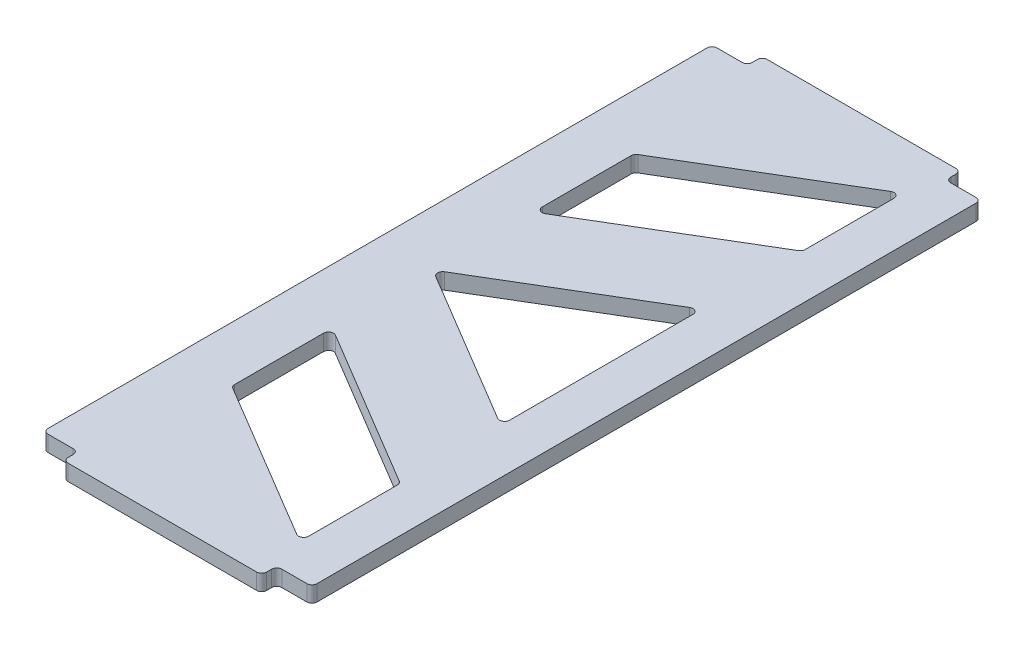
ISO-10303-21;
HEADER;
FILE_DESCRIPTION(('STEP AP214'),'2;1');
FILE_NAME('part.step','',(''),(''),'','','');
FILE_SCHEMA(('AUTOMOTIVE_DESIGN { 1 0 10303 214 1 1 1 1 }'));
ENDSEC;
DATA;
#1=APPLICATION_CONTEXT('core data for automotive mechanical design processes');
#2=APPLICATION_PROTOCOL_DEFINITION('international standard','automotive_design',2000,#1);
#3=PRODUCT_CONTEXT('',#1,'mechanical');
#4=PRODUCT('Part','Part','',(#3));
#5=PRODUCT_RELATED_PRODUCT_CATEGORY('part','',(#4));
#6=PRODUCT_DEFINITION_FORMATION('','',#4);
#7=PRODUCT_DEFINITION_CONTEXT('part definition',#1,'design');
#8=PRODUCT_DEFINITION('design','',#6,#7);
#9=PRODUCT_DEFINITION_SHAPE('','',#8);
#10=(LENGTH_UNIT() NAMED_UNIT(*) SI_UNIT(.MILLI.,.METRE.));
#11=(NAMED_UNIT(*) PLANE_ANGLE_UNIT() SI_UNIT($,.RADIAN.));
#12=(NAMED_UNIT(*) SI_UNIT($,.STERADIAN.) SOLID_ANGLE_UNIT());
#13=UNCERTAINTY_MEASURE_WITH_UNIT(LENGTH_MEASURE(1.E-05),#10,'distance_accuracy_value','');
#14=(GEOMETRIC_REPRESENTATION_CONTEXT(3) GLOBAL_UNCERTAINTY_ASSIGNED_CONTEXT((#13)) GLOBAL_UNIT_ASSIGNED_CONTEXT((#10,
#11,#12)) REPRESENTATION_CONTEXT('',''));
#15=CARTESIAN_POINT('',(0.,0.,0.));
#16=DIRECTION('',(0.,0.,1.));
#17=DIRECTION('',(1.,0.,0.));
#18=AXIS2_PLACEMENT_3D('',#15,#16,#17);
#19=CARTESIAN_POINT('',(0.,3.175,-14.675));
#20=DIRECTION('',(0.,0.,-1.));
#21=DIRECTION('',(-1.,0.,0.));
#22=AXIS2_PLACEMENT_3D('',#19,#20,#21);
#23=PLANE('',#22);
#24=DIRECTION('',(1.,0.,0.));
#25=VECTOR('',#24,1.);
#26=CARTESIAN_POINT('',(0.,3.175,-14.675));
#27=LINE('',#26,#25);
#28=CARTESIAN_POINT('',(91.5,3.175,-14.675));
#29=VERTEX_POINT('',#28);
#30=CARTESIAN_POINT('',(96.5,3.175,-14.675));
#31=VERTEX_POINT('',#30);
#32=EDGE_CURVE('E375',#29,#31,#27,.T.);
#33=ORIENTED_EDGE('',*,*,#32,.F.);
#34=DIRECTION('',(0.,1.,0.));
#35=VECTOR('',#34,1.);
#36=CARTESIAN_POINT('',(91.5,3.175,-14.675));
#37=LINE('',#36,#35);
#38=CARTESIAN_POINT('',(91.5,0.,-14.675));
#39=VERTEX_POINT('',#38);
#40=EDGE_CURVE('E888',#29,#39,#37,.F.);
#41=ORIENTED_EDGE('',*,*,#40,.T.);
#42=DIRECTION('',(1.,0.,0.));
#43=VECTOR('',#42,1.);
#44=CARTESIAN_POINT('',(0.,0.,-14.675));
#45=LINE('',#44,#43);
#46=CARTESIAN_POINT('',(96.5,0.,-14.675));
#47=VERTEX_POINT('',#46);
#48=EDGE_CURVE('E359',#39,#47,#45,.T.);
#49=ORIENTED_EDGE('',*,*,#48,.T.);
#50=DIRECTION('',(0.,-1.,0.));
#51=VECTOR('',#50,1.);
#52=CARTESIAN_POINT('',(96.5,3.175,-14.675));
#53=LINE('',#52,#51);
#54=EDGE_CURVE('E427',#47,#31,#53,.F.);
#55=ORIENTED_EDGE('',*,*,#54,.T.);
#56=EDGE_LOOP('',(#33,#41,#49,#55));
#57=FACE_BOUND('',#56,.T.);
#58=ADVANCED_FACE('F34',(#57),#23,.F.);
#59=CARTESIAN_POINT('',(138.,0.,-14.675));
#60=VERTEX_POINT('',#59);
#61=CARTESIAN_POINT('',(143.,0.,-14.675));
#62=VERTEX_POINT('',#61);
#63=EDGE_CURVE('E355',#60,#62,#45,.T.);
#64=ORIENTED_EDGE('',*,*,#63,.T.);
#65=DIRECTION('',(0.,1.,0.));
#66=VECTOR('',#65,1.);
#67=CARTESIAN_POINT('',(143.,3.175,-14.675));
#68=LINE('',#67,#66);
#69=CARTESIAN_POINT('',(143.,3.175,-14.675));
#70=VERTEX_POINT('',#69);
#71=EDGE_CURVE('E829',#62,#70,#68,.T.);
#72=ORIENTED_EDGE('',*,*,#71,.T.);
#73=CARTESIAN_POINT('',(138.,3.175,-14.675));
#74=VERTEX_POINT('',#73);
#75=EDGE_CURVE('E371',#74,#70,#27,.T.);
#76=ORIENTED_EDGE('',*,*,#75,.F.);
#77=DIRECTION('',(0.,1.,0.));
#78=VECTOR('',#77,1.);
#79=CARTESIAN_POINT('',(138.,0.,-14.675));
#80=LINE('',#79,#78);
#81=EDGE_CURVE('E826',#74,#60,#80,.F.);
#82=ORIENTED_EDGE('',*,*,#81,.T.);
#83=EDGE_LOOP('',(#64,#72,#76,#82));
#84=FACE_BOUND('',#83,.T.);
#85=ADVANCED_FACE('F657',(#84),#23,.F.);
#86=CARTESIAN_POINT('',(0.,3.175,-147.77));
#87=DIRECTION('',(0.,0.,-1.));
#88=DIRECTION('',(-1.,0.,0.));
#89=AXIS2_PLACEMENT_3D('',#86,#87,#88);
#90=PLANE('',#89);
#91=DIRECTION('',(1.,0.,0.));
#92=VECTOR('',#91,1.);
#93=CARTESIAN_POINT('',(0.,3.175,-147.77));
#94=LINE('',#93,#92);
#95=CARTESIAN_POINT('',(138.,3.175,-147.77));
#96=VERTEX_POINT('',#95);
#97=CARTESIAN_POINT('',(143.,3.175,-147.77));
#98=VERTEX_POINT('',#97);
#99=EDGE_CURVE('E379',#96,#98,#94,.T.);
#100=ORIENTED_EDGE('',*,*,#99,.T.);
#101=DIRECTION('',(0.,-1.,0.));
#102=VECTOR('',#101,1.);
#103=CARTESIAN_POINT('',(143.,3.175,-147.77));
#104=LINE('',#103,#102);
#105=CARTESIAN_POINT('',(143.,0.,-147.77));
#106=VERTEX_POINT('',#105);
#107=EDGE_CURVE('E779',#98,#106,#104,.T.);
#108=ORIENTED_EDGE('',*,*,#107,.T.);
#109=DIRECTION('',(1.,0.,0.));
#110=VECTOR('',#109,1.);
#111=CARTESIAN_POINT('',(0.,0.,-147.77));
#112=LINE('',#111,#110);
#113=CARTESIAN_POINT('',(138.,0.,-147.77));
#114=VERTEX_POINT('',#113);
#115=EDGE_CURVE('E431',#114,#106,#112,.T.);
#116=ORIENTED_EDGE('',*,*,#115,.F.);
#117=DIRECTION('',(0.,-1.,0.));
#118=VECTOR('',#117,1.);
#119=CARTESIAN_POINT('',(138.,3.175,-147.77));
#120=LINE('',#119,#118);
#121=EDGE_CURVE('E778',#114,#96,#120,.F.);
#122=ORIENTED_EDGE('',*,*,#121,.T.);
#123=EDGE_LOOP('',(#100,#108,#116,#122));
#124=FACE_BOUND('',#123,.T.);
#125=ADVANCED_FACE('F663',(#124),#90,.T.);
#126=CARTESIAN_POINT('',(90.5,3.175,0.));
#127=DIRECTION('',(1.,0.,0.));
#128=DIRECTION('',(0.,0.,-1.));
#129=AXIS2_PLACEMENT_3D('',#126,#127,#128);
#130=PLANE('',#129);
#131=DIRECTION('',(0.,0.,1.));
#132=VECTOR('',#131,1.);
#133=CARTESIAN_POINT('',(90.5,0.,0.));
#134=LINE('',#133,#132);
#135=CARTESIAN_POINT('',(90.5,0.,-146.77));
#136=VERTEX_POINT('',#135);
#137=CARTESIAN_POINT('',(90.5,0.,-15.675));
#138=VERTEX_POINT('',#137);
#139=EDGE_CURVE('E764',#136,#138,#134,.T.);
#140=ORIENTED_EDGE('',*,*,#139,.T.);
#141=DIRECTION('',(0.,1.,0.));
#142=VECTOR('',#141,1.);
#143=CARTESIAN_POINT('',(90.5,3.175,-15.675));
#144=LINE('',#143,#142);
#145=CARTESIAN_POINT('',(90.5,3.175,-15.675));
#146=VERTEX_POINT('',#145);
#147=EDGE_CURVE('E395',#138,#146,#144,.T.);
#148=ORIENTED_EDGE('',*,*,#147,.T.);
#149=DIRECTION('',(0.,0.,1.));
#150=VECTOR('',#149,1.);
#151=CARTESIAN_POINT('',(90.5,3.175,0.));
#152=LINE('',#151,#150);
#153=CARTESIAN_POINT('',(90.5,3.175,-146.77));
#154=VERTEX_POINT('',#153);
#155=EDGE_CURVE('E464',#154,#146,#152,.T.);
#156=ORIENTED_EDGE('',*,*,#155,.F.);
#157=DIRECTION('',(0.,-1.,0.));
#158=VECTOR('',#157,1.);
#159=CARTESIAN_POINT('',(90.5,0.,-146.77));
#160=LINE('',#159,#158);
#161=EDGE_CURVE('E393',#154,#136,#160,.T.);
#162=ORIENTED_EDGE('',*,*,#161,.T.);
#163=EDGE_LOOP('',(#140,#148,#156,#162));
#164=FACE_BOUND('',#163,.T.);
#165=ADVANCED_FACE('F763',(#164),#130,.F.);
#166=CARTESIAN_POINT('',(144.,3.175,0.));
#167=DIRECTION('',(1.,0.,0.));
#168=DIRECTION('',(0.,0.,-1.));
#169=AXIS2_PLACEMENT_3D('',#166,#167,#168);
#170=PLANE('',#169);
#171=DIRECTION('',(0.,0.,1.));
#172=VECTOR('',#171,1.);
#173=CARTESIAN_POINT('',(144.,3.175,0.));
#174=LINE('',#173,#172);
#175=CARTESIAN_POINT('',(144.,3.175,-146.77));
#176=VERTEX_POINT('',#175);
#177=CARTESIAN_POINT('',(144.,3.175,-15.675));
#178=VERTEX_POINT('',#177);
#179=EDGE_CURVE('E436',#176,#178,#174,.T.);
#180=ORIENTED_EDGE('',*,*,#179,.T.);
#181=DIRECTION('',(0.,1.,0.));
#182=VECTOR('',#181,1.);
#183=CARTESIAN_POINT('',(144.,0.,-15.675));
#184=LINE('',#183,#182);
#185=CARTESIAN_POINT('',(144.,0.,-15.675));
#186=VERTEX_POINT('',#185);
#187=EDGE_CURVE('E784',#178,#186,#184,.F.);
#188=ORIENTED_EDGE('',*,*,#187,.T.);
#189=DIRECTION('',(0.,0.,1.));
#190=VECTOR('',#189,1.);
#191=CARTESIAN_POINT('',(144.,0.,0.));
#192=LINE('',#191,#190);
#193=CARTESIAN_POINT('',(144.,0.,-146.77));
#194=VERTEX_POINT('',#193);
#195=EDGE_CURVE('E481',#194,#186,#192,.T.);
#196=ORIENTED_EDGE('',*,*,#195,.F.);
#197=DIRECTION('',(0.,-1.,0.));
#198=VECTOR('',#197,1.);
#199=CARTESIAN_POINT('',(144.,3.175,-146.77));
#200=LINE('',#199,#198);
#201=EDGE_CURVE('E788',#194,#176,#200,.F.);
#202=ORIENTED_EDGE('',*,*,#201,.T.);
#203=EDGE_LOOP('',(#180,#188,#196,#202));
#204=FACE_BOUND('',#203,.T.);
#205=ADVANCED_FACE('F838',(#204),#170,.T.);
#206=CARTESIAN_POINT('',(91.5,3.175,-147.77));
#207=VERTEX_POINT('',#206);
#208=CARTESIAN_POINT('',(96.5,3.175,-147.77));
#209=VERTEX_POINT('',#208);
#210=EDGE_CURVE('E380',#207,#209,#94,.T.);
#211=ORIENTED_EDGE('',*,*,#210,.T.);
#212=DIRECTION('',(0.,1.,0.));
#213=VECTOR('',#212,1.);
#214=CARTESIAN_POINT('',(96.5,3.175,-147.77));
#215=LINE('',#214,#213);
#216=CARTESIAN_POINT('',(96.5,0.,-147.77));
#217=VERTEX_POINT('',#216);
#218=EDGE_CURVE('E807',#209,#217,#215,.F.);
#219=ORIENTED_EDGE('',*,*,#218,.T.);
#220=CARTESIAN_POINT('',(91.5,0.,-147.77));
#221=VERTEX_POINT('',#220);
#222=EDGE_CURVE('E601',#221,#217,#112,.T.);
#223=ORIENTED_EDGE('',*,*,#222,.F.);
#224=DIRECTION('',(0.,-1.,0.));
#225=VECTOR('',#224,1.);
#226=CARTESIAN_POINT('',(91.5,3.175,-147.77));
#227=LINE('',#226,#225);
#228=EDGE_CURVE('E760',#221,#207,#227,.F.);
#229=ORIENTED_EDGE('',*,*,#228,.T.);
#230=EDGE_LOOP('',(#211,#219,#223,#229));
#231=FACE_BOUND('',#230,.T.);
#232=ADVANCED_FACE('F668',(#231),#90,.T.);
#233=CARTESIAN_POINT('',(0.,3.175,0.));
#234=DIRECTION('',(0.,1.,0.));
#235=DIRECTION('',(0.,0.,1.));
#236=AXIS2_PLACEMENT_3D('',#233,#234,#235);
#237=PLANE('',#236);
#238=ORIENTED_EDGE('',*,*,#155,.T.);
#239=CARTESIAN_POINT('',(91.5,3.175,-15.675));
#240=DIRECTION('',(0.,1.,0.));
#241=DIRECTION('',(0.,0.,1.));
#242=AXIS2_PLACEMENT_3D('',#239,#240,#241);
#243=CIRCLE('',#242,1.);
#244=EDGE_CURVE('E425',#146,#29,#243,.T.);
#245=ORIENTED_EDGE('',*,*,#244,.T.);
#246=ORIENTED_EDGE('',*,*,#32,.T.);
#247=CARTESIAN_POINT('',(96.5,3.175,-13.675));
#248=DIRECTION('',(0.,1.,0.));
#249=DIRECTION('',(0.,0.,1.));
#250=AXIS2_PLACEMENT_3D('',#247,#248,#249);
#251=CIRCLE('',#250,1.);
#252=CARTESIAN_POINT('',(97.5,3.175,-13.675));
#253=VERTEX_POINT('',#252);
#254=EDGE_CURVE('E810',#31,#253,#251,.F.);
#255=ORIENTED_EDGE('',*,*,#254,.T.);
#256=DIRECTION('',(0.,0.,-1.));
#257=VECTOR('',#256,1.);
#258=CARTESIAN_POINT('',(97.5,3.175,-11.675));
#259=LINE('',#258,#257);
#260=CARTESIAN_POINT('',(97.5,3.175,-12.675));
#261=VERTEX_POINT('',#260);
#262=EDGE_CURVE('E382',#261,#253,#259,.T.);
#263=ORIENTED_EDGE('',*,*,#262,.F.);
#264=CARTESIAN_POINT('',(98.5,3.175,-12.675));
#265=DIRECTION('',(0.,1.,0.));
#266=DIRECTION('',(0.,0.,1.));
#267=AXIS2_PLACEMENT_3D('',#264,#265,#266);
#268=CIRCLE('',#267,1.);
#269=CARTESIAN_POINT('',(98.5,3.175,-11.675));
#270=VERTEX_POINT('',#269);
#271=EDGE_CURVE('E423',#261,#270,#268,.T.);
#272=ORIENTED_EDGE('',*,*,#271,.T.);
#273=DIRECTION('',(-1.,0.,0.));
#274=VECTOR('',#273,1.);
#275=CARTESIAN_POINT('',(97.5,3.175,-11.675));
#276=LINE('',#275,#274);
#277=CARTESIAN_POINT('',(136.,3.175,-11.675));
#278=VERTEX_POINT('',#277);
#279=EDGE_CURVE('E386',#278,#270,#276,.T.);
#280=ORIENTED_EDGE('',*,*,#279,.F.);
#281=CARTESIAN_POINT('',(136.,3.175,-12.675));
#282=DIRECTION('',(0.,1.,0.));
#283=DIRECTION('',(0.,0.,1.));
#284=AXIS2_PLACEMENT_3D('',#281,#282,#283);
#285=CIRCLE('',#284,1.);
#286=CARTESIAN_POINT('',(137.,3.175,-12.675));
#287=VERTEX_POINT('',#286);
#288=EDGE_CURVE('E421',#278,#287,#285,.T.);
#289=ORIENTED_EDGE('',*,*,#288,.T.);
#290=DIRECTION('',(0.,0.,-1.));
#291=VECTOR('',#290,1.);
#292=CARTESIAN_POINT('',(137.,3.175,-11.675));
#293=LINE('',#292,#291);
#294=CARTESIAN_POINT('',(137.,3.175,-13.675));
#295=VERTEX_POINT('',#294);
#296=EDGE_CURVE('E385',#287,#295,#293,.T.);
#297=ORIENTED_EDGE('',*,*,#296,.T.);
#298=CARTESIAN_POINT('',(138.,3.175,-13.675));
#299=DIRECTION('',(0.,1.,0.));
#300=DIRECTION('',(0.,0.,1.));
#301=AXIS2_PLACEMENT_3D('',#298,#299,#300);
#302=CIRCLE('',#301,1.);
#303=EDGE_CURVE('E42',#295,#74,#302,.F.);
#304=ORIENTED_EDGE('',*,*,#303,.T.);
#305=ORIENTED_EDGE('',*,*,#75,.T.);
#306=CARTESIAN_POINT('',(143.,3.175,-15.675));
#307=DIRECTION('',(0.,1.,0.));
#308=DIRECTION('',(0.,0.,1.));
#309=AXIS2_PLACEMENT_3D('',#306,#307,#308);
#310=CIRCLE('',#309,1.);
#311=EDGE_CURVE('E419',#70,#178,#310,.T.);
#312=ORIENTED_EDGE('',*,*,#311,.T.);
#313=ORIENTED_EDGE('',*,*,#179,.F.);
#314=CARTESIAN_POINT('',(143.,3.175,-146.77));
#315=DIRECTION('',(0.,1.,0.));
#316=DIRECTION('',(0.,0.,1.));
#317=AXIS2_PLACEMENT_3D('',#314,#315,#316);
#318=CIRCLE('',#317,1.);
#319=EDGE_CURVE('E417',#176,#98,#318,.T.);
#320=ORIENTED_EDGE('',*,*,#319,.T.);
#321=ORIENTED_EDGE('',*,*,#99,.F.);
#322=CARTESIAN_POINT('',(138.,3.175,-148.77));
#323=DIRECTION('',(0.,1.,0.));
#324=DIRECTION('',(0.,0.,1.));
#325=AXIS2_PLACEMENT_3D('',#322,#323,#324);
#326=CIRCLE('',#325,1.);
#327=CARTESIAN_POINT('',(137.,3.175,-148.77));
#328=VERTEX_POINT('',#327);
#329=EDGE_CURVE('E783',#96,#328,#326,.F.);
#330=ORIENTED_EDGE('',*,*,#329,.T.);
#331=DIRECTION('',(0.,0.,1.));
#332=VECTOR('',#331,1.);
#333=CARTESIAN_POINT('',(137.,3.175,-150.77));
#334=LINE('',#333,#332);
#335=CARTESIAN_POINT('',(137.,3.175,-149.77));
#336=VERTEX_POINT('',#335);
#337=EDGE_CURVE('E455',#336,#328,#334,.T.);
#338=ORIENTED_EDGE('',*,*,#337,.F.);
#339=CARTESIAN_POINT('',(136.,3.175,-149.77));
#340=DIRECTION('',(0.,1.,0.));
#341=DIRECTION('',(0.,0.,1.));
#342=AXIS2_PLACEMENT_3D('',#339,#340,#341);
#343=CIRCLE('',#342,1.);
#344=CARTESIAN_POINT('',(136.,3.175,-150.77));
#345=VERTEX_POINT('',#344);
#346=EDGE_CURVE('E409',#336,#345,#343,.T.);
#347=ORIENTED_EDGE('',*,*,#346,.T.);
#348=DIRECTION('',(1.,0.,0.));
#349=VECTOR('',#348,1.);
#350=CARTESIAN_POINT('',(137.,3.175,-150.77));
#351=LINE('',#350,#349);
#352=CARTESIAN_POINT('',(98.5,3.175,-150.77));
#353=VERTEX_POINT('',#352);
#354=EDGE_CURVE('E457',#353,#345,#351,.T.);
#355=ORIENTED_EDGE('',*,*,#354,.F.);
#356=CARTESIAN_POINT('',(98.5,3.175,-149.77));
#357=DIRECTION('',(0.,1.,0.));
#358=DIRECTION('',(0.,0.,1.));
#359=AXIS2_PLACEMENT_3D('',#356,#357,#358);
#360=CIRCLE('',#359,1.);
#361=CARTESIAN_POINT('',(97.5,3.175,-149.77));
#362=VERTEX_POINT('',#361);
#363=EDGE_CURVE('E404',#353,#362,#360,.T.);
#364=ORIENTED_EDGE('',*,*,#363,.T.);
#365=DIRECTION('',(0.,0.,1.));
#366=VECTOR('',#365,1.);
#367=CARTESIAN_POINT('',(97.5,3.175,-150.77));
#368=LINE('',#367,#366);
#369=CARTESIAN_POINT('',(97.5,3.175,-148.77));
#370=VERTEX_POINT('',#369);
#371=EDGE_CURVE('E412',#362,#370,#368,.T.);
#372=ORIENTED_EDGE('',*,*,#371,.T.);
#373=CARTESIAN_POINT('',(96.5,3.175,-148.77));
#374=DIRECTION('',(0.,1.,0.));
#375=DIRECTION('',(0.,0.,1.));
#376=AXIS2_PLACEMENT_3D('',#373,#374,#375);
#377=CIRCLE('',#376,1.);
#378=EDGE_CURVE('E814',#370,#209,#377,.F.);
#379=ORIENTED_EDGE('',*,*,#378,.T.);
#380=ORIENTED_EDGE('',*,*,#210,.F.);
#381=CARTESIAN_POINT('',(91.5,3.175,-146.77));
#382=DIRECTION('',(0.,1.,0.));
#383=DIRECTION('',(0.,0.,1.));
#384=AXIS2_PLACEMENT_3D('',#381,#382,#383);
#385=CIRCLE('',#384,1.);
#386=EDGE_CURVE('E398',#207,#154,#385,.T.);
#387=ORIENTED_EDGE('',*,*,#386,.T.);
#388=EDGE_LOOP('',(#238,#245,#246,#255,#263,#272,#280,#289,#297,#304,#305,#312,#313,#320,#321,
#330,#338,#347,#355,#364,#372,#379,#380,#387));
#389=FACE_BOUND('',#388,.T.);
#390=DIRECTION('',(0.,0.,-1.));
#391=VECTOR('',#390,1.);
#392=CARTESIAN_POINT('',(135.,3.175,-141.21));
#393=LINE('',#392,#391);
#394=CARTESIAN_POINT('',(135.,3.175,-121.802642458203));
#395=VERTEX_POINT('',#394);
#396=CARTESIAN_POINT('',(135.,3.175,-139.449456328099));
#397=VERTEX_POINT('',#396);
#398=EDGE_CURVE('E603',#395,#397,#393,.T.);
#399=ORIENTED_EDGE('',*,*,#398,.F.);
#400=CARTESIAN_POINT('',(134.,3.175,-121.802642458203));
#401=DIRECTION('',(0.,1.,0.));
#402=DIRECTION('',(0.,0.,1.));
#403=AXIS2_PLACEMENT_3D('',#400,#401,#402);
#404=CIRCLE('',#403,1.);
#405=CARTESIAN_POINT('',(134.512609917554,3.175,-120.944020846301));
#406=VERTEX_POINT('',#405);
#407=EDGE_CURVE('E585',#395,#406,#404,.F.);
#408=ORIENTED_EDGE('',*,*,#407,.T.);
#409=DIRECTION('',(0.858621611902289,0.,-0.512609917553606));
#410=VECTOR('',#409,1.);
#411=CARTESIAN_POINT('',(101.5,3.175,-101.235));
#412=LINE('',#411,#410);
#413=CARTESIAN_POINT('',(103.012609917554,3.175,-102.138050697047));
#414=VERTEX_POINT('',#413);
#415=EDGE_CURVE('E619',#414,#406,#412,.T.);
#416=ORIENTED_EDGE('',*,*,#415,.F.);
#417=CARTESIAN_POINT('',(102.5,3.175,-102.996672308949));
#418=DIRECTION('',(0.,1.,0.));
#419=DIRECTION('',(0.,0.,1.));
#420=AXIS2_PLACEMENT_3D('',#417,#418,#419);
#421=CIRCLE('',#420,1.);
#422=CARTESIAN_POINT('',(101.5,3.175,-102.996672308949));
#423=VERTEX_POINT('',#422);
#424=EDGE_CURVE('E573',#414,#423,#421,.F.);
#425=ORIENTED_EDGE('',*,*,#424,.T.);
#426=DIRECTION('',(0.,0.,1.));
#427=VECTOR('',#426,1.);
#428=CARTESIAN_POINT('',(101.5,3.175,-121.235));
#429=LINE('',#428,#427);
#430=CARTESIAN_POINT('',(101.5,3.175,-120.666993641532));
#431=VERTEX_POINT('',#430);
#432=EDGE_CURVE('E612',#431,#423,#429,.T.);
#433=ORIENTED_EDGE('',*,*,#432,.F.);
#434=CARTESIAN_POINT('',(102.5,3.175,-120.666993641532));
#435=DIRECTION('',(0.,1.,0.));
#436=DIRECTION('',(0.,0.,1.));
#437=AXIS2_PLACEMENT_3D('',#434,#435,#436);
#438=CIRCLE('',#437,1.);
#439=CARTESIAN_POINT('',(101.987862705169,3.175,-121.525897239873));
#440=VERTEX_POINT('',#439);
#441=EDGE_CURVE('E577',#431,#440,#438,.F.);
#442=ORIENTED_EDGE('',*,*,#441,.T.);
#443=DIRECTION('',(-0.858903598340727,0.,0.512137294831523));
#444=VECTOR('',#443,1.);
#445=CARTESIAN_POINT('',(101.5,3.175,-121.235));
#446=LINE('',#445,#444);
#447=CARTESIAN_POINT('',(133.487862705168,3.175,-140.30835992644));
#448=VERTEX_POINT('',#447);
#449=EDGE_CURVE('E606',#448,#440,#446,.T.);
#450=ORIENTED_EDGE('',*,*,#449,.F.);
#451=CARTESIAN_POINT('',(134.,3.175,-139.449456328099));
#452=DIRECTION('',(0.,1.,0.));
#453=DIRECTION('',(0.,0.,1.));
#454=AXIS2_PLACEMENT_3D('',#451,#452,#453);
#455=CIRCLE('',#454,1.);
#456=EDGE_CURVE('E581',#448,#397,#455,.F.);
#457=ORIENTED_EDGE('',*,*,#456,.T.);
#458=EDGE_LOOP('',(#399,#408,#416,#425,#433,#442,#450,#457));
#459=FACE_BOUND('',#458,.T.);
#460=DIRECTION('',(0.,0.,-1.));
#461=VECTOR('',#460,1.);
#462=CARTESIAN_POINT('',(135.,3.175,-101.235));
#463=LINE('',#462,#461);
#464=CARTESIAN_POINT('',(135.,3.175,-62.9966723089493));
#465=VERTEX_POINT('',#464);
#466=CARTESIAN_POINT('',(135.,3.175,-99.4733276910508));
#467=VERTEX_POINT('',#466);
#468=EDGE_CURVE('E622',#465,#467,#463,.T.);
#469=ORIENTED_EDGE('',*,*,#468,.F.);
#470=CARTESIAN_POINT('',(134.,3.175,-62.9966723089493));
#471=DIRECTION('',(0.,1.,0.));
#472=DIRECTION('',(0.,0.,1.));
#473=AXIS2_PLACEMENT_3D('',#470,#471,#472);
#474=CIRCLE('',#473,1.);
#475=CARTESIAN_POINT('',(133.487390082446,3.175,-62.138050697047));
#476=VERTEX_POINT('',#475);
#477=EDGE_CURVE('E569',#465,#476,#474,.F.);
#478=ORIENTED_EDGE('',*,*,#477,.T.);
#479=DIRECTION('',(0.85862161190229,0.,0.512609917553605));
#480=VECTOR('',#479,1.);
#481=CARTESIAN_POINT('',(101.5,3.175,-81.2350000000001));
#482=LINE('',#481,#480);
#483=CARTESIAN_POINT('',(102.938191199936,3.175,-80.3763783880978));
#484=VERTEX_POINT('',#483);
#485=EDGE_CURVE('E628',#484,#476,#482,.T.);
#486=ORIENTED_EDGE('',*,*,#485,.F.);
#487=CARTESIAN_POINT('',(103.45080111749,3.175,-81.2350000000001));
#488=DIRECTION('',(0.,1.,0.));
#489=DIRECTION('',(0.,0.,1.));
#490=AXIS2_PLACEMENT_3D('',#487,#488,#489);
#491=CIRCLE('',#490,1.);
#492=CARTESIAN_POINT('',(102.938191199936,3.175,-82.0936216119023));
#493=VERTEX_POINT('',#492);
#494=EDGE_CURVE('E589',#484,#493,#491,.F.);
#495=ORIENTED_EDGE('',*,*,#494,.T.);
#496=DIRECTION('',(-0.85862161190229,0.,0.512609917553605));
#497=VECTOR('',#496,1.);
#498=CARTESIAN_POINT('',(101.5,3.175,-81.2350000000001));
#499=LINE('',#498,#497);
#500=CARTESIAN_POINT('',(133.487390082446,3.175,-100.331949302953));
#501=VERTEX_POINT('',#500);
#502=EDGE_CURVE('E625',#501,#493,#499,.T.);
#503=ORIENTED_EDGE('',*,*,#502,.F.);
#504=CARTESIAN_POINT('',(134.,3.175,-99.4733276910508));
#505=DIRECTION('',(0.,1.,0.));
#506=DIRECTION('',(0.,0.,1.));
#507=AXIS2_PLACEMENT_3D('',#504,#505,#506);
#508=CIRCLE('',#507,1.);
#509=EDGE_CURVE('E565',#501,#467,#508,.F.);
#510=ORIENTED_EDGE('',*,*,#509,.T.);
#511=EDGE_LOOP('',(#469,#478,#486,#495,#503,#510));
#512=FACE_BOUND('',#511,.T.);
#513=DIRECTION('',(0.858903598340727,0.,0.512137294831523));
#514=VECTOR('',#513,1.);
#515=CARTESIAN_POINT('',(101.5,3.175,-41.2350000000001));
#516=LINE('',#515,#514);
#517=CARTESIAN_POINT('',(101.987862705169,3.175,-40.9441027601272));
#518=VERTEX_POINT('',#517);
#519=CARTESIAN_POINT('',(133.487862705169,3.175,-22.1616400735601));
#520=VERTEX_POINT('',#519);
#521=EDGE_CURVE('E631',#518,#520,#516,.T.);
#522=ORIENTED_EDGE('',*,*,#521,.F.);
#523=CARTESIAN_POINT('',(102.5,3.175,-41.803006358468));
#524=DIRECTION('',(0.,1.,0.));
#525=DIRECTION('',(0.,0.,1.));
#526=AXIS2_PLACEMENT_3D('',#523,#524,#525);
#527=CIRCLE('',#526,1.);
#528=CARTESIAN_POINT('',(101.5,3.175,-41.803006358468));
#529=VERTEX_POINT('',#528);
#530=EDGE_CURVE('E354',#518,#529,#527,.F.);
#531=ORIENTED_EDGE('',*,*,#530,.T.);
#532=DIRECTION('',(0.,0.,1.));
#533=VECTOR('',#532,1.);
#534=CARTESIAN_POINT('',(101.5,3.175,-41.2350000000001));
#535=LINE('',#534,#533);
#536=CARTESIAN_POINT('',(101.5,3.175,-59.4733276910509));
#537=VERTEX_POINT('',#536);
#538=EDGE_CURVE('E345',#537,#529,#535,.T.);
#539=ORIENTED_EDGE('',*,*,#538,.F.);
#540=CARTESIAN_POINT('',(102.5,3.175,-59.4733276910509));
#541=DIRECTION('',(0.,1.,0.));
#542=DIRECTION('',(0.,0.,1.));
#543=AXIS2_PLACEMENT_3D('',#540,#541,#542);
#544=CIRCLE('',#543,1.);
#545=CARTESIAN_POINT('',(103.012609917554,3.175,-60.3319493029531));
#546=VERTEX_POINT('',#545);
#547=EDGE_CURVE('E328',#537,#546,#544,.F.);
#548=ORIENTED_EDGE('',*,*,#547,.T.);
#549=DIRECTION('',(-0.858621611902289,0.,-0.512609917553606));
#550=VECTOR('',#549,1.);
#551=CARTESIAN_POINT('',(101.5,3.175,-61.2350000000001));
#552=LINE('',#551,#550);
#553=CARTESIAN_POINT('',(134.512609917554,3.175,-41.5259791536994));
#554=VERTEX_POINT('',#553);
#555=EDGE_CURVE('E356',#554,#546,#552,.T.);
#556=ORIENTED_EDGE('',*,*,#555,.F.);
#557=CARTESIAN_POINT('',(134.,3.175,-40.6673575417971));
#558=DIRECTION('',(0.,1.,0.));
#559=DIRECTION('',(0.,0.,1.));
#560=AXIS2_PLACEMENT_3D('',#557,#558,#559);
#561=CIRCLE('',#560,1.);
#562=CARTESIAN_POINT('',(135.,3.175,-40.6673575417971));
#563=VERTEX_POINT('',#562);
#564=EDGE_CURVE('E557',#554,#563,#561,.F.);
#565=ORIENTED_EDGE('',*,*,#564,.T.);
#566=DIRECTION('',(0.,0.,-1.));
#567=VECTOR('',#566,1.);
#568=CARTESIAN_POINT('',(135.,3.175,-21.2600000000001));
#569=LINE('',#568,#567);
#570=CARTESIAN_POINT('',(135.,3.175,-23.0205436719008));
#571=VERTEX_POINT('',#570);
#572=EDGE_CURVE('E361',#571,#563,#569,.T.);
#573=ORIENTED_EDGE('',*,*,#572,.F.);
#574=CARTESIAN_POINT('',(134.,3.175,-23.0205436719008));
#575=DIRECTION('',(0.,1.,0.));
#576=DIRECTION('',(0.,0.,1.));
#577=AXIS2_PLACEMENT_3D('',#574,#575,#576);
#578=CIRCLE('',#577,1.);
#579=EDGE_CURVE('E561',#571,#520,#578,.F.);
#580=ORIENTED_EDGE('',*,*,#579,.T.);
#581=EDGE_LOOP('',(#522,#531,#539,#548,#556,#565,#573,#580));
#582=FACE_BOUND('',#581,.T.);
#583=ADVANCED_FACE('F353',(#389,#459,#512,#582),#237,.T.);
#584=CARTESIAN_POINT('',(0.,0.,0.));
#585=DIRECTION('',(0.,1.,0.));
#586=DIRECTION('',(0.,0.,1.));
#587=AXIS2_PLACEMENT_3D('',#584,#585,#586);
#588=PLANE('',#587);
#589=DIRECTION('',(0.,0.,1.));
#590=VECTOR('',#589,1.);
#591=CARTESIAN_POINT('',(101.5,0.,0.));
#592=LINE('',#591,#590);
#593=CARTESIAN_POINT('',(101.5,0.,-120.666993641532));
#594=VERTEX_POINT('',#593);
#595=CARTESIAN_POINT('',(101.5,0.,-102.996672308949));
#596=VERTEX_POINT('',#595);
#597=EDGE_CURVE('E499',#594,#596,#592,.T.);
#598=ORIENTED_EDGE('',*,*,#597,.T.);
#599=CARTESIAN_POINT('',(102.5,0.,-102.996672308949));
#600=DIRECTION('',(0.,1.,0.));
#601=DIRECTION('',(0.,0.,1.));
#602=AXIS2_PLACEMENT_3D('',#599,#600,#601);
#603=CIRCLE('',#602,1.);
#604=CARTESIAN_POINT('',(103.012609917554,0.,-102.138050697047));
#605=VERTEX_POINT('',#604);
#606=EDGE_CURVE('E575',#596,#605,#603,.T.);
#607=ORIENTED_EDGE('',*,*,#606,.T.);
#608=DIRECTION('',(0.858621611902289,0.,-0.512609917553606));
#609=VECTOR('',#608,1.);
#610=CARTESIAN_POINT('',(-17.8863195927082,0.,-29.9595853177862));
#611=LINE('',#610,#609);
#612=CARTESIAN_POINT('',(134.512609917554,0.,-120.944020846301));
#613=VERTEX_POINT('',#612);
#614=EDGE_CURVE('E502',#605,#613,#611,.T.);
#615=ORIENTED_EDGE('',*,*,#614,.T.);
#616=CARTESIAN_POINT('',(134.,0.,-121.802642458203));
#617=DIRECTION('',(0.,1.,0.));
#618=DIRECTION('',(0.,0.,1.));
#619=AXIS2_PLACEMENT_3D('',#616,#617,#618);
#620=CIRCLE('',#619,1.);
#621=CARTESIAN_POINT('',(135.,0.,-121.802642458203));
#622=VERTEX_POINT('',#621);
#623=EDGE_CURVE('E587',#613,#622,#620,.T.);
#624=ORIENTED_EDGE('',*,*,#623,.T.);
#625=DIRECTION('',(0.,0.,-1.));
#626=VECTOR('',#625,1.);
#627=CARTESIAN_POINT('',(135.,0.,0.));
#628=LINE('',#627,#626);
#629=CARTESIAN_POINT('',(135.,0.,-139.449456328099));
#630=VERTEX_POINT('',#629);
#631=EDGE_CURVE('E505',#622,#630,#628,.T.);
#632=ORIENTED_EDGE('',*,*,#631,.T.);
#633=CARTESIAN_POINT('',(134.,0.,-139.449456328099));
#634=DIRECTION('',(0.,1.,0.));
#635=DIRECTION('',(0.,0.,1.));
#636=AXIS2_PLACEMENT_3D('',#633,#634,#635);
#637=CIRCLE('',#636,1.);
#638=CARTESIAN_POINT('',(133.487862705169,0.,-140.30835992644));
#639=VERTEX_POINT('',#638);
#640=EDGE_CURVE('E583',#630,#639,#637,.T.);
#641=ORIENTED_EDGE('',*,*,#640,.T.);
#642=DIRECTION('',(-0.858903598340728,0.,0.512137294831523));
#643=VECTOR('',#642,1.);
#644=CARTESIAN_POINT('',(-26.7065476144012,0.,-44.7894540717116));
#645=LINE('',#644,#643);
#646=CARTESIAN_POINT('',(101.987862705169,0.,-121.525897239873));
#647=VERTEX_POINT('',#646);
#648=EDGE_CURVE('E496',#639,#647,#645,.T.);
#649=ORIENTED_EDGE('',*,*,#648,.T.);
#650=CARTESIAN_POINT('',(102.5,0.,-120.666993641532));
#651=DIRECTION('',(0.,1.,0.));
#652=DIRECTION('',(0.,0.,1.));
#653=AXIS2_PLACEMENT_3D('',#650,#651,#652);
#654=CIRCLE('',#653,1.);
#655=EDGE_CURVE('E579',#647,#594,#654,.T.);
#656=ORIENTED_EDGE('',*,*,#655,.T.);
#657=EDGE_LOOP('',(#598,#607,#615,#624,#632,#641,#649,#656));
#658=FACE_BOUND('',#657,.T.);
#659=DIRECTION('',(-0.85862161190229,0.,0.512609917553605));
#660=VECTOR('',#659,1.);
#661=CARTESIAN_POINT('',(-9.08356051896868,0.,-15.2149638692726));
#662=LINE('',#661,#660);
#663=CARTESIAN_POINT('',(133.487390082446,0.,-100.331949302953));
#664=VERTEX_POINT('',#663);
#665=CARTESIAN_POINT('',(102.938191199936,0.,-82.0936216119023));
#666=VERTEX_POINT('',#665);
#667=EDGE_CURVE('E487',#664,#666,#662,.T.);
#668=ORIENTED_EDGE('',*,*,#667,.T.);
#669=CARTESIAN_POINT('',(103.45080111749,0.,-81.2350000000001));
#670=DIRECTION('',(0.,1.,0.));
#671=DIRECTION('',(0.,0.,1.));
#672=AXIS2_PLACEMENT_3D('',#669,#670,#671);
#673=CIRCLE('',#672,1.);
#674=CARTESIAN_POINT('',(102.938191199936,0.,-80.3763783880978));
#675=VERTEX_POINT('',#674);
#676=EDGE_CURVE('E591',#666,#675,#673,.T.);
#677=ORIENTED_EDGE('',*,*,#676,.T.);
#678=DIRECTION('',(0.85862161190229,0.,0.512609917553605));
#679=VECTOR('',#678,1.);
#680=CARTESIAN_POINT('',(62.4256528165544,0.,-104.562968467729));
#681=LINE('',#680,#679);
#682=CARTESIAN_POINT('',(133.487390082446,0.,-62.138050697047));
#683=VERTEX_POINT('',#682);
#684=EDGE_CURVE('E490',#675,#683,#681,.T.);
#685=ORIENTED_EDGE('',*,*,#684,.T.);
#686=CARTESIAN_POINT('',(134.,0.,-62.9966723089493));
#687=DIRECTION('',(0.,1.,0.));
#688=DIRECTION('',(0.,0.,1.));
#689=AXIS2_PLACEMENT_3D('',#686,#687,#688);
#690=CIRCLE('',#689,1.);
#691=CARTESIAN_POINT('',(135.,0.,-62.9966723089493));
#692=VERTEX_POINT('',#691);
#693=EDGE_CURVE('E571',#683,#692,#690,.T.);
#694=ORIENTED_EDGE('',*,*,#693,.T.);
#695=DIRECTION('',(0.,0.,-1.));
#696=VECTOR('',#695,1.);
#697=CARTESIAN_POINT('',(135.,0.,0.));
#698=LINE('',#697,#696);
#699=CARTESIAN_POINT('',(135.,0.,-99.4733276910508));
#700=VERTEX_POINT('',#699);
#701=EDGE_CURVE('E493',#692,#700,#698,.T.);
#702=ORIENTED_EDGE('',*,*,#701,.T.);
#703=CARTESIAN_POINT('',(134.,0.,-99.4733276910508));
#704=DIRECTION('',(0.,1.,0.));
#705=DIRECTION('',(0.,0.,1.));
#706=AXIS2_PLACEMENT_3D('',#703,#704,#705);
#707=CIRCLE('',#706,1.);
#708=EDGE_CURVE('E567',#700,#664,#707,.T.);
#709=ORIENTED_EDGE('',*,*,#708,.T.);
#710=EDGE_LOOP('',(#668,#677,#685,#694,#702,#709));
#711=FACE_BOUND('',#710,.T.);
#712=DIRECTION('',(-0.858621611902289,0.,-0.512609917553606));
#713=VECTOR('',#712,1.);
#714=CARTESIAN_POINT('',(53.622893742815,0.,-89.8183470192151));
#715=LINE('',#714,#713);
#716=CARTESIAN_POINT('',(134.512609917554,0.,-41.5259791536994));
#717=VERTEX_POINT('',#716);
#718=CARTESIAN_POINT('',(103.012609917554,0.,-60.3319493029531));
#719=VERTEX_POINT('',#718);
#720=EDGE_CURVE('E473',#717,#719,#715,.T.);
#721=ORIENTED_EDGE('',*,*,#720,.T.);
#722=CARTESIAN_POINT('',(102.5,0.,-59.4733276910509));
#723=DIRECTION('',(0.,1.,0.));
#724=DIRECTION('',(0.,0.,1.));
#725=AXIS2_PLACEMENT_3D('',#722,#723,#724);
#726=CIRCLE('',#725,1.);
#727=CARTESIAN_POINT('',(101.5,0.,-59.4733276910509));
#728=VERTEX_POINT('',#727);
#729=EDGE_CURVE('E338',#719,#728,#726,.T.);
#730=ORIENTED_EDGE('',*,*,#729,.T.);
#731=DIRECTION('',(0.,0.,1.));
#732=VECTOR('',#731,1.);
#733=CARTESIAN_POINT('',(101.5,0.,0.));
#734=LINE('',#733,#732);
#735=CARTESIAN_POINT('',(101.5,0.,-41.803006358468));
#736=VERTEX_POINT('',#735);
#737=EDGE_CURVE('E348',#728,#736,#734,.T.);
#738=ORIENTED_EDGE('',*,*,#737,.T.);
#739=CARTESIAN_POINT('',(102.5,0.,-41.803006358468));
#740=DIRECTION('',(0.,1.,0.));
#741=DIRECTION('',(0.,0.,1.));
#742=AXIS2_PLACEMENT_3D('',#739,#740,#741);
#743=CIRCLE('',#742,1.);
#744=CARTESIAN_POINT('',(101.987862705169,0.,-40.9441027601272));
#745=VERTEX_POINT('',#744);
#746=EDGE_CURVE('E396',#736,#745,#743,.T.);
#747=ORIENTED_EDGE('',*,*,#746,.T.);
#748=DIRECTION('',(0.858903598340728,0.,0.512137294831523));
#749=VECTOR('',#748,1.);
#750=CARTESIAN_POINT('',(44.7601979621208,0.,-75.0671655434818));
#751=LINE('',#750,#749);
#752=CARTESIAN_POINT('',(133.487862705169,0.,-22.1616400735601));
#753=VERTEX_POINT('',#752);
#754=EDGE_CURVE('E484',#745,#753,#751,.T.);
#755=ORIENTED_EDGE('',*,*,#754,.T.);
#756=CARTESIAN_POINT('',(134.,0.,-23.0205436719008));
#757=DIRECTION('',(0.,1.,0.));
#758=DIRECTION('',(0.,0.,1.));
#759=AXIS2_PLACEMENT_3D('',#756,#757,#758);
#760=CIRCLE('',#759,1.);
#761=CARTESIAN_POINT('',(135.,0.,-23.0205436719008));
#762=VERTEX_POINT('',#761);
#763=EDGE_CURVE('E563',#753,#762,#760,.T.);
#764=ORIENTED_EDGE('',*,*,#763,.T.);
#765=DIRECTION('',(0.,0.,-1.));
#766=VECTOR('',#765,1.);
#767=CARTESIAN_POINT('',(135.,0.,0.));
#768=LINE('',#767,#766);
#769=CARTESIAN_POINT('',(135.,0.,-40.6673575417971));
#770=VERTEX_POINT('',#769);
#771=EDGE_CURVE('E468',#762,#770,#768,.T.);
#772=ORIENTED_EDGE('',*,*,#771,.T.);
#773=CARTESIAN_POINT('',(134.,0.,-40.6673575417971));
#774=DIRECTION('',(0.,1.,0.));
#775=DIRECTION('',(0.,0.,1.));
#776=AXIS2_PLACEMENT_3D('',#773,#774,#775);
#777=CIRCLE('',#776,1.);
#778=EDGE_CURVE('E559',#770,#717,#777,.T.);
#779=ORIENTED_EDGE('',*,*,#778,.T.);
#780=EDGE_LOOP('',(#721,#730,#738,#747,#755,#764,#772,#779));
#781=FACE_BOUND('',#780,.T.);
#782=ORIENTED_EDGE('',*,*,#48,.F.);
#783=CARTESIAN_POINT('',(91.5,0.,-15.675));
#784=DIRECTION('',(0.,1.,0.));
#785=DIRECTION('',(0.,0.,1.));
#786=AXIS2_PLACEMENT_3D('',#783,#784,#785);
#787=CIRCLE('',#786,1.);
#788=EDGE_CURVE('E769',#39,#138,#787,.F.);
#789=ORIENTED_EDGE('',*,*,#788,.T.);
#790=ORIENTED_EDGE('',*,*,#139,.F.);
#791=CARTESIAN_POINT('',(91.5,0.,-146.77));
#792=DIRECTION('',(0.,1.,0.));
#793=DIRECTION('',(0.,0.,1.));
#794=AXIS2_PLACEMENT_3D('',#791,#792,#793);
#795=CIRCLE('',#794,1.);
#796=EDGE_CURVE('E761',#136,#221,#795,.F.);
#797=ORIENTED_EDGE('',*,*,#796,.T.);
#798=ORIENTED_EDGE('',*,*,#222,.T.);
#799=CARTESIAN_POINT('',(96.5,0.,-148.77));
#800=DIRECTION('',(0.,1.,0.));
#801=DIRECTION('',(0.,0.,1.));
#802=AXIS2_PLACEMENT_3D('',#799,#800,#801);
#803=CIRCLE('',#802,1.);
#804=CARTESIAN_POINT('',(97.5,0.,-148.77));
#805=VERTEX_POINT('',#804);
#806=EDGE_CURVE('E816',#217,#805,#803,.T.);
#807=ORIENTED_EDGE('',*,*,#806,.T.);
#808=DIRECTION('',(0.,0.,1.));
#809=VECTOR('',#808,1.);
#810=CARTESIAN_POINT('',(97.5,0.,-150.77));
#811=LINE('',#810,#809);
#812=CARTESIAN_POINT('',(97.5,0.,-149.77));
#813=VERTEX_POINT('',#812);
#814=EDGE_CURVE('E597',#813,#805,#811,.T.);
#815=ORIENTED_EDGE('',*,*,#814,.F.);
#816=CARTESIAN_POINT('',(98.5,0.,-149.77));
#817=DIRECTION('',(0.,1.,0.));
#818=DIRECTION('',(0.,0.,1.));
#819=AXIS2_PLACEMENT_3D('',#816,#817,#818);
#820=CIRCLE('',#819,1.);
#821=CARTESIAN_POINT('',(98.5,0.,-150.77));
#822=VERTEX_POINT('',#821);
#823=EDGE_CURVE('E845',#813,#822,#820,.F.);
#824=ORIENTED_EDGE('',*,*,#823,.T.);
#825=DIRECTION('',(-1.,0.,0.));
#826=VECTOR('',#825,1.);
#827=CARTESIAN_POINT('',(137.,0.,-150.77));
#828=LINE('',#827,#826);
#829=CARTESIAN_POINT('',(136.,0.,-150.77));
#830=VERTEX_POINT('',#829);
#831=EDGE_CURVE('E877',#830,#822,#828,.T.);
#832=ORIENTED_EDGE('',*,*,#831,.F.);
#833=CARTESIAN_POINT('',(136.,0.,-149.77));
#834=DIRECTION('',(0.,1.,0.));
#835=DIRECTION('',(0.,0.,1.));
#836=AXIS2_PLACEMENT_3D('',#833,#834,#835);
#837=CIRCLE('',#836,1.);
#838=CARTESIAN_POINT('',(137.,0.,-149.77));
#839=VERTEX_POINT('',#838);
#840=EDGE_CURVE('E841',#830,#839,#837,.F.);
#841=ORIENTED_EDGE('',*,*,#840,.T.);
#842=DIRECTION('',(0.,0.,1.));
#843=VECTOR('',#842,1.);
#844=CARTESIAN_POINT('',(137.,0.,-150.77));
#845=LINE('',#844,#843);
#846=CARTESIAN_POINT('',(137.,0.,-148.77));
#847=VERTEX_POINT('',#846);
#848=EDGE_CURVE('E600',#839,#847,#845,.T.);
#849=ORIENTED_EDGE('',*,*,#848,.T.);
#850=CARTESIAN_POINT('',(138.,0.,-148.77));
#851=DIRECTION('',(0.,1.,0.));
#852=DIRECTION('',(0.,0.,1.));
#853=AXIS2_PLACEMENT_3D('',#850,#851,#852);
#854=CIRCLE('',#853,1.);
#855=EDGE_CURVE('E776',#847,#114,#854,.T.);
#856=ORIENTED_EDGE('',*,*,#855,.T.);
#857=ORIENTED_EDGE('',*,*,#115,.T.);
#858=CARTESIAN_POINT('',(143.,0.,-146.77));
#859=DIRECTION('',(0.,1.,0.));
#860=DIRECTION('',(0.,0.,1.));
#861=AXIS2_PLACEMENT_3D('',#858,#859,#860);
#862=CIRCLE('',#861,1.);
#863=EDGE_CURVE('E774',#106,#194,#862,.F.);
#864=ORIENTED_EDGE('',*,*,#863,.T.);
#865=ORIENTED_EDGE('',*,*,#195,.T.);
#866=CARTESIAN_POINT('',(143.,0.,-15.675));
#867=DIRECTION('',(0.,1.,0.));
#868=DIRECTION('',(0.,0.,1.));
#869=AXIS2_PLACEMENT_3D('',#866,#867,#868);
#870=CIRCLE('',#869,1.);
#871=EDGE_CURVE('E840',#186,#62,#870,.F.);
#872=ORIENTED_EDGE('',*,*,#871,.T.);
#873=ORIENTED_EDGE('',*,*,#63,.F.);
#874=CARTESIAN_POINT('',(138.,0.,-13.675));
#875=DIRECTION('',(0.,1.,0.));
#876=DIRECTION('',(0.,0.,1.));
#877=AXIS2_PLACEMENT_3D('',#874,#875,#876);
#878=CIRCLE('',#877,1.);
#879=CARTESIAN_POINT('',(137.,0.,-13.675));
#880=VERTEX_POINT('',#879);
#881=EDGE_CURVE('E11',#60,#880,#878,.T.);
#882=ORIENTED_EDGE('',*,*,#881,.T.);
#883=DIRECTION('',(0.,0.,-1.));
#884=VECTOR('',#883,1.);
#885=CARTESIAN_POINT('',(137.,0.,-11.675));
#886=LINE('',#885,#884);
#887=CARTESIAN_POINT('',(137.,0.,-12.675));
#888=VERTEX_POINT('',#887);
#889=EDGE_CURVE('E443',#888,#880,#886,.T.);
#890=ORIENTED_EDGE('',*,*,#889,.F.);
#891=CARTESIAN_POINT('',(136.,0.,-12.675));
#892=DIRECTION('',(0.,1.,0.));
#893=DIRECTION('',(0.,0.,1.));
#894=AXIS2_PLACEMENT_3D('',#891,#892,#893);
#895=CIRCLE('',#894,1.);
#896=CARTESIAN_POINT('',(136.,0.,-11.675));
#897=VERTEX_POINT('',#896);
#898=EDGE_CURVE('E843',#888,#897,#895,.F.);
#899=ORIENTED_EDGE('',*,*,#898,.T.);
#900=DIRECTION('',(1.,0.,0.));
#901=VECTOR('',#900,1.);
#902=CARTESIAN_POINT('',(97.5,0.,-11.675));
#903=LINE('',#902,#901);
#904=CARTESIAN_POINT('',(98.5,0.,-11.675));
#905=VERTEX_POINT('',#904);
#906=EDGE_CURVE('E872',#905,#897,#903,.T.);
#907=ORIENTED_EDGE('',*,*,#906,.F.);
#908=CARTESIAN_POINT('',(98.5,0.,-12.675));
#909=DIRECTION('',(0.,1.,0.));
#910=DIRECTION('',(0.,0.,1.));
#911=AXIS2_PLACEMENT_3D('',#908,#909,#910);
#912=CIRCLE('',#911,1.);
#913=CARTESIAN_POINT('',(97.5,0.,-12.675));
#914=VERTEX_POINT('',#913);
#915=EDGE_CURVE('E57',#905,#914,#912,.F.);
#916=ORIENTED_EDGE('',*,*,#915,.T.);
#917=DIRECTION('',(0.,0.,-1.));
#918=VECTOR('',#917,1.);
#919=CARTESIAN_POINT('',(97.5,0.,-11.675));
#920=LINE('',#919,#918);
#921=CARTESIAN_POINT('',(97.5,0.,-13.675));
#922=VERTEX_POINT('',#921);
#923=EDGE_CURVE('E446',#914,#922,#920,.T.);
#924=ORIENTED_EDGE('',*,*,#923,.T.);
#925=CARTESIAN_POINT('',(96.5,0.,-13.675));
#926=DIRECTION('',(0.,1.,0.));
#927=DIRECTION('',(0.,0.,1.));
#928=AXIS2_PLACEMENT_3D('',#925,#926,#927);
#929=CIRCLE('',#928,1.);
#930=EDGE_CURVE('E49',#922,#47,#929,.T.);
#931=ORIENTED_EDGE('',*,*,#930,.T.);
#932=EDGE_LOOP('',(#782,#789,#790,#797,#798,#807,#815,#824,#832,#841,#849,#856,#857,#864,#865,
#872,#873,#882,#890,#899,#907,#916,#924,#931));
#933=FACE_BOUND('',#932,.T.);
#934=ADVANCED_FACE('F643',(#658,#711,#781,#933),#588,.F.);
#935=CARTESIAN_POINT('',(101.5,-6.825,-41.2350000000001));
#936=DIRECTION('',(-0.512137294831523,0.,0.858903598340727));
#937=DIRECTION('',(0.858903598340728,0.,0.512137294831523));
#938=AXIS2_PLACEMENT_3D('',#935,#936,#937);
#939=PLANE('',#938);
#940=ORIENTED_EDGE('',*,*,#521,.T.);
#941=DIRECTION('',(0.,1.,0.));
#942=VECTOR('',#941,1.);
#943=CARTESIAN_POINT('',(133.487862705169,0.,-22.1616400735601));
#944=LINE('',#943,#942);
#945=EDGE_CURVE('E520',#520,#753,#944,.F.);
#946=ORIENTED_EDGE('',*,*,#945,.T.);
#947=ORIENTED_EDGE('',*,*,#754,.F.);
#948=DIRECTION('',(0.,1.,0.));
#949=VECTOR('',#948,1.);
#950=CARTESIAN_POINT('',(101.987862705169,3.175,-40.9441027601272));
#951=LINE('',#950,#949);
#952=EDGE_CURVE('E517',#745,#518,#951,.T.);
#953=ORIENTED_EDGE('',*,*,#952,.T.);
#954=EDGE_LOOP('',(#940,#946,#947,#953));
#955=FACE_BOUND('',#954,.T.);
#956=ADVANCED_FACE('F654',(#955),#939,.F.);
#957=CARTESIAN_POINT('',(101.5,-6.825,-41.2350000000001));
#958=DIRECTION('',(-1.,0.,0.));
#959=DIRECTION('',(0.,0.,1.));
#960=AXIS2_PLACEMENT_3D('',#957,#958,#959);
#961=PLANE('',#960);
#962=ORIENTED_EDGE('',*,*,#737,.F.);
#963=DIRECTION('',(0.,1.,0.));
#964=VECTOR('',#963,1.);
#965=CARTESIAN_POINT('',(101.5,3.175,-59.4733276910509));
#966=LINE('',#965,#964);
#967=EDGE_CURVE('E332',#728,#537,#966,.T.);
#968=ORIENTED_EDGE('',*,*,#967,.T.);
#969=ORIENTED_EDGE('',*,*,#538,.T.);
#970=DIRECTION('',(0.,1.,0.));
#971=VECTOR('',#970,1.);
#972=CARTESIAN_POINT('',(101.5,0.,-41.803006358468));
#973=LINE('',#972,#971);
#974=EDGE_CURVE('E350',#529,#736,#973,.F.);
#975=ORIENTED_EDGE('',*,*,#974,.T.);
#976=EDGE_LOOP('',(#962,#968,#969,#975));
#977=FACE_BOUND('',#976,.T.);
#978=ADVANCED_FACE('F344',(#977),#961,.F.);
#979=CARTESIAN_POINT('',(101.5,-6.825,-61.2350000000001));
#980=DIRECTION('',(0.512609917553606,0.,-0.858621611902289));
#981=DIRECTION('',(-0.858621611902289,0.,-0.512609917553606));
#982=AXIS2_PLACEMENT_3D('',#979,#980,#981);
#983=PLANE('',#982);
#984=ORIENTED_EDGE('',*,*,#555,.T.);
#985=DIRECTION('',(0.,1.,0.));
#986=VECTOR('',#985,1.);
#987=CARTESIAN_POINT('',(103.012609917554,0.,-60.3319493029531));
#988=LINE('',#987,#986);
#989=EDGE_CURVE('E333',#546,#719,#988,.F.);
#990=ORIENTED_EDGE('',*,*,#989,.T.);
#991=ORIENTED_EDGE('',*,*,#720,.F.);
#992=DIRECTION('',(0.,1.,0.));
#993=VECTOR('',#992,1.);
#994=CARTESIAN_POINT('',(134.512609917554,3.175,-41.5259791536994));
#995=LINE('',#994,#993);
#996=EDGE_CURVE('E349',#717,#554,#995,.T.);
#997=ORIENTED_EDGE('',*,*,#996,.T.);
#998=EDGE_LOOP('',(#984,#990,#991,#997));
#999=FACE_BOUND('',#998,.T.);
#1000=ADVANCED_FACE('F645',(#999),#983,.F.);
#1001=CARTESIAN_POINT('',(135.,-6.825,-21.2600000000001));
#1002=DIRECTION('',(1.,0.,0.));
#1003=DIRECTION('',(0.,0.,-1.));
#1004=AXIS2_PLACEMENT_3D('',#1001,#1002,#1003);
#1005=PLANE('',#1004);
#1006=ORIENTED_EDGE('',*,*,#572,.T.);
#1007=DIRECTION('',(0.,1.,0.));
#1008=VECTOR('',#1007,1.);
#1009=CARTESIAN_POINT('',(135.,0.,-40.6673575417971));
#1010=LINE('',#1009,#1008);
#1011=EDGE_CURVE('E515',#563,#770,#1010,.F.);
#1012=ORIENTED_EDGE('',*,*,#1011,.T.);
#1013=ORIENTED_EDGE('',*,*,#771,.F.);
#1014=DIRECTION('',(0.,1.,0.));
#1015=VECTOR('',#1014,1.);
#1016=CARTESIAN_POINT('',(135.,3.175,-23.0205436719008));
#1017=LINE('',#1016,#1015);
#1018=EDGE_CURVE('E512',#762,#571,#1017,.T.);
#1019=ORIENTED_EDGE('',*,*,#1018,.T.);
#1020=EDGE_LOOP('',(#1006,#1012,#1013,#1019));
#1021=FACE_BOUND('',#1020,.T.);
#1022=ADVANCED_FACE('F637',(#1021),#1005,.F.);
#1023=CARTESIAN_POINT('',(135.,-6.825,-101.235));
#1024=DIRECTION('',(1.,0.,0.));
#1025=DIRECTION('',(0.,0.,-1.));
#1026=AXIS2_PLACEMENT_3D('',#1023,#1024,#1025);
#1027=PLANE('',#1026);
#1028=ORIENTED_EDGE('',*,*,#468,.T.);
#1029=DIRECTION('',(0.,1.,0.));
#1030=VECTOR('',#1029,1.);
#1031=CARTESIAN_POINT('',(135.,0.,-99.4733276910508));
#1032=LINE('',#1031,#1030);
#1033=EDGE_CURVE('E530',#467,#700,#1032,.F.);
#1034=ORIENTED_EDGE('',*,*,#1033,.T.);
#1035=ORIENTED_EDGE('',*,*,#701,.F.);
#1036=DIRECTION('',(0.,1.,0.));
#1037=VECTOR('',#1036,1.);
#1038=CARTESIAN_POINT('',(135.,3.175,-62.9966723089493));
#1039=LINE('',#1038,#1037);
#1040=EDGE_CURVE('E527',#692,#465,#1039,.T.);
#1041=ORIENTED_EDGE('',*,*,#1040,.T.);
#1042=EDGE_LOOP('',(#1028,#1034,#1035,#1041));
#1043=FACE_BOUND('',#1042,.T.);
#1044=ADVANCED_FACE('F652',(#1043),#1027,.F.);
#1045=CARTESIAN_POINT('',(101.5,-6.825,-81.2350000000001));
#1046=DIRECTION('',(-0.512609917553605,0.,0.85862161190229));
#1047=DIRECTION('',(0.85862161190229,0.,0.512609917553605));
#1048=AXIS2_PLACEMENT_3D('',#1045,#1046,#1047);
#1049=PLANE('',#1048);
#1050=ORIENTED_EDGE('',*,*,#485,.T.);
#1051=DIRECTION('',(0.,1.,0.));
#1052=VECTOR('',#1051,1.);
#1053=CARTESIAN_POINT('',(133.487390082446,0.,-62.138050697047));
#1054=LINE('',#1053,#1052);
#1055=EDGE_CURVE('E535',#476,#683,#1054,.F.);
#1056=ORIENTED_EDGE('',*,*,#1055,.T.);
#1057=ORIENTED_EDGE('',*,*,#684,.F.);
#1058=DIRECTION('',(0.,1.,0.));
#1059=VECTOR('',#1058,1.);
#1060=CARTESIAN_POINT('',(102.938191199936,3.175,-80.3763783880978));
#1061=LINE('',#1060,#1059);
#1062=EDGE_CURVE('E532',#675,#484,#1061,.T.);
#1063=ORIENTED_EDGE('',*,*,#1062,.T.);
#1064=EDGE_LOOP('',(#1050,#1056,#1057,#1063));
#1065=FACE_BOUND('',#1064,.T.);
#1066=ADVANCED_FACE('F926',(#1065),#1049,.F.);
#1067=CARTESIAN_POINT('',(101.5,-6.825,-81.2350000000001));
#1068=DIRECTION('',(-0.512609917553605,0.,-0.85862161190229));
#1069=DIRECTION('',(-0.85862161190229,0.,0.512609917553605));
#1070=AXIS2_PLACEMENT_3D('',#1067,#1068,#1069);
#1071=PLANE('',#1070);
#1072=ORIENTED_EDGE('',*,*,#667,.F.);
#1073=DIRECTION('',(0.,1.,0.));
#1074=VECTOR('',#1073,1.);
#1075=CARTESIAN_POINT('',(133.487390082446,3.175,-100.331949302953));
#1076=LINE('',#1075,#1074);
#1077=EDGE_CURVE('E524',#664,#501,#1076,.T.);
#1078=ORIENTED_EDGE('',*,*,#1077,.T.);
#1079=ORIENTED_EDGE('',*,*,#502,.T.);
#1080=DIRECTION('',(0.,1.,0.));
#1081=VECTOR('',#1080,1.);
#1082=CARTESIAN_POINT('',(102.938191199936,0.,-82.0936216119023));
#1083=LINE('',#1082,#1081);
#1084=EDGE_CURVE('E522',#493,#666,#1083,.F.);
#1085=ORIENTED_EDGE('',*,*,#1084,.T.);
#1086=EDGE_LOOP('',(#1072,#1078,#1079,#1085));
#1087=FACE_BOUND('',#1086,.T.);
#1088=ADVANCED_FACE('F925',(#1087),#1071,.F.);
#1089=CARTESIAN_POINT('',(135.,-6.825,-141.21));
#1090=DIRECTION('',(1.,0.,0.));
#1091=DIRECTION('',(0.,0.,-1.));
#1092=AXIS2_PLACEMENT_3D('',#1089,#1090,#1091);
#1093=PLANE('',#1092);
#1094=ORIENTED_EDGE('',*,*,#398,.T.);
#1095=DIRECTION('',(0.,1.,0.));
#1096=VECTOR('',#1095,1.);
#1097=CARTESIAN_POINT('',(135.,0.,-139.449456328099));
#1098=LINE('',#1097,#1096);
#1099=EDGE_CURVE('E339',#397,#630,#1098,.F.);
#1100=ORIENTED_EDGE('',*,*,#1099,.T.);
#1101=ORIENTED_EDGE('',*,*,#631,.F.);
#1102=DIRECTION('',(0.,1.,0.));
#1103=VECTOR('',#1102,1.);
#1104=CARTESIAN_POINT('',(135.,3.175,-121.802642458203));
#1105=LINE('',#1104,#1103);
#1106=EDGE_CURVE('E552',#622,#395,#1105,.T.);
#1107=ORIENTED_EDGE('',*,*,#1106,.T.);
#1108=EDGE_LOOP('',(#1094,#1100,#1101,#1107));
#1109=FACE_BOUND('',#1108,.T.);
#1110=ADVANCED_FACE('F915',(#1109),#1093,.F.);
#1111=CARTESIAN_POINT('',(101.5,-6.825,-101.235));
#1112=DIRECTION('',(0.512609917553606,0.,0.858621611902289));
#1113=DIRECTION('',(0.858621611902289,0.,-0.512609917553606));
#1114=AXIS2_PLACEMENT_3D('',#1111,#1112,#1113);
#1115=PLANE('',#1114);
#1116=ORIENTED_EDGE('',*,*,#614,.F.);
#1117=DIRECTION('',(0.,1.,0.));
#1118=VECTOR('',#1117,1.);
#1119=CARTESIAN_POINT('',(103.012609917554,3.175,-102.138050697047));
#1120=LINE('',#1119,#1118);
#1121=EDGE_CURVE('E539',#605,#414,#1120,.T.);
#1122=ORIENTED_EDGE('',*,*,#1121,.T.);
#1123=ORIENTED_EDGE('',*,*,#415,.T.);
#1124=DIRECTION('',(0.,1.,0.));
#1125=VECTOR('',#1124,1.);
#1126=CARTESIAN_POINT('',(134.512609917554,0.,-120.944020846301));
#1127=LINE('',#1126,#1125);
#1128=EDGE_CURVE('E537',#406,#613,#1127,.F.);
#1129=ORIENTED_EDGE('',*,*,#1128,.T.);
#1130=EDGE_LOOP('',(#1116,#1122,#1123,#1129));
#1131=FACE_BOUND('',#1130,.T.);
#1132=ADVANCED_FACE('F911',(#1131),#1115,.F.);
#1133=CARTESIAN_POINT('',(101.5,-6.825,-121.235));
#1134=DIRECTION('',(-1.,0.,0.));
#1135=DIRECTION('',(0.,0.,1.));
#1136=AXIS2_PLACEMENT_3D('',#1133,#1134,#1135);
#1137=PLANE('',#1136);
#1138=ORIENTED_EDGE('',*,*,#432,.T.);
#1139=DIRECTION('',(0.,1.,0.));
#1140=VECTOR('',#1139,1.);
#1141=CARTESIAN_POINT('',(101.5,0.,-102.996672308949));
#1142=LINE('',#1141,#1140);
#1143=EDGE_CURVE('E545',#423,#596,#1142,.F.);
#1144=ORIENTED_EDGE('',*,*,#1143,.T.);
#1145=ORIENTED_EDGE('',*,*,#597,.F.);
#1146=DIRECTION('',(0.,1.,0.));
#1147=VECTOR('',#1146,1.);
#1148=CARTESIAN_POINT('',(101.5,3.175,-120.666993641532));
#1149=LINE('',#1148,#1147);
#1150=EDGE_CURVE('E542',#594,#431,#1149,.T.);
#1151=ORIENTED_EDGE('',*,*,#1150,.T.);
#1152=EDGE_LOOP('',(#1138,#1144,#1145,#1151));
#1153=FACE_BOUND('',#1152,.T.);
#1154=ADVANCED_FACE('F914',(#1153),#1137,.F.);
#1155=CARTESIAN_POINT('',(101.5,-6.825,-121.235));
#1156=DIRECTION('',(-0.512137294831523,0.,-0.858903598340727));
#1157=DIRECTION('',(-0.858903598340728,0.,0.512137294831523));
#1158=AXIS2_PLACEMENT_3D('',#1155,#1156,#1157);
#1159=PLANE('',#1158);
#1160=ORIENTED_EDGE('',*,*,#449,.T.);
#1161=DIRECTION('',(0.,1.,0.));
#1162=VECTOR('',#1161,1.);
#1163=CARTESIAN_POINT('',(101.987862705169,0.,-121.525897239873));
#1164=LINE('',#1163,#1162);
#1165=EDGE_CURVE('E550',#440,#647,#1164,.F.);
#1166=ORIENTED_EDGE('',*,*,#1165,.T.);
#1167=ORIENTED_EDGE('',*,*,#648,.F.);
#1168=DIRECTION('',(0.,1.,0.));
#1169=VECTOR('',#1168,1.);
#1170=CARTESIAN_POINT('',(133.487862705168,3.175,-140.30835992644));
#1171=LINE('',#1170,#1169);
#1172=EDGE_CURVE('E547',#639,#448,#1171,.T.);
#1173=ORIENTED_EDGE('',*,*,#1172,.T.);
#1174=EDGE_LOOP('',(#1160,#1166,#1167,#1173));
#1175=FACE_BOUND('',#1174,.T.);
#1176=ADVANCED_FACE('F672',(#1175),#1159,.F.);
#1177=CARTESIAN_POINT('',(102.5,-6.825,-59.4733276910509));
#1178=DIRECTION('',(0.,-1.,0.));
#1179=DIRECTION('',(0.,0.,-1.));
#1180=AXIS2_PLACEMENT_3D('',#1177,#1178,#1179);
#1181=CYLINDRICAL_SURFACE('',#1180,1.);
#1182=ORIENTED_EDGE('',*,*,#729,.F.);
#1183=ORIENTED_EDGE('',*,*,#989,.F.);
#1184=ORIENTED_EDGE('',*,*,#547,.F.);
#1185=ORIENTED_EDGE('',*,*,#967,.F.);
#1186=EDGE_LOOP('',(#1182,#1183,#1184,#1185));
#1187=FACE_BOUND('',#1186,.T.);
#1188=ADVANCED_FACE('F331',(#1187),#1181,.F.);
#1189=CARTESIAN_POINT('',(134.,-6.825,-40.6673575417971));
#1190=DIRECTION('',(0.,-1.,0.));
#1191=DIRECTION('',(0.,0.,-1.));
#1192=AXIS2_PLACEMENT_3D('',#1189,#1190,#1191);
#1193=CYLINDRICAL_SURFACE('',#1192,1.);
#1194=ORIENTED_EDGE('',*,*,#778,.F.);
#1195=ORIENTED_EDGE('',*,*,#1011,.F.);
#1196=ORIENTED_EDGE('',*,*,#564,.F.);
#1197=ORIENTED_EDGE('',*,*,#996,.F.);
#1198=EDGE_LOOP('',(#1194,#1195,#1196,#1197));
#1199=FACE_BOUND('',#1198,.T.);
#1200=ADVANCED_FACE('F640',(#1199),#1193,.F.);
#1201=CARTESIAN_POINT('',(134.,-6.825,-23.0205436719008));
#1202=DIRECTION('',(0.,-1.,0.));
#1203=DIRECTION('',(0.,0.,-1.));
#1204=AXIS2_PLACEMENT_3D('',#1201,#1202,#1203);
#1205=CYLINDRICAL_SURFACE('',#1204,1.);
#1206=ORIENTED_EDGE('',*,*,#763,.F.);
#1207=ORIENTED_EDGE('',*,*,#945,.F.);
#1208=ORIENTED_EDGE('',*,*,#579,.F.);
#1209=ORIENTED_EDGE('',*,*,#1018,.F.);
#1210=EDGE_LOOP('',(#1206,#1207,#1208,#1209));
#1211=FACE_BOUND('',#1210,.T.);
#1212=ADVANCED_FACE('F675',(#1211),#1205,.F.);
#1213=CARTESIAN_POINT('',(134.,-6.825,-99.4733276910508));
#1214=DIRECTION('',(0.,-1.,0.));
#1215=DIRECTION('',(0.,0.,-1.));
#1216=AXIS2_PLACEMENT_3D('',#1213,#1214,#1215);
#1217=CYLINDRICAL_SURFACE('',#1216,1.);
#1218=ORIENTED_EDGE('',*,*,#708,.F.);
#1219=ORIENTED_EDGE('',*,*,#1033,.F.);
#1220=ORIENTED_EDGE('',*,*,#509,.F.);
#1221=ORIENTED_EDGE('',*,*,#1077,.F.);
#1222=EDGE_LOOP('',(#1218,#1219,#1220,#1221));
#1223=FACE_BOUND('',#1222,.T.);
#1224=ADVANCED_FACE('F678',(#1223),#1217,.F.);
#1225=CARTESIAN_POINT('',(134.,-6.825,-62.9966723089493));
#1226=DIRECTION('',(0.,-1.,0.));
#1227=DIRECTION('',(0.,0.,-1.));
#1228=AXIS2_PLACEMENT_3D('',#1225,#1226,#1227);
#1229=CYLINDRICAL_SURFACE('',#1228,1.);
#1230=ORIENTED_EDGE('',*,*,#693,.F.);
#1231=ORIENTED_EDGE('',*,*,#1055,.F.);
#1232=ORIENTED_EDGE('',*,*,#477,.F.);
#1233=ORIENTED_EDGE('',*,*,#1040,.F.);
#1234=EDGE_LOOP('',(#1230,#1231,#1232,#1233));
#1235=FACE_BOUND('',#1234,.T.);
#1236=ADVANCED_FACE('F682',(#1235),#1229,.F.);
#1237=CARTESIAN_POINT('',(102.5,-6.825,-102.996672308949));
#1238=DIRECTION('',(0.,-1.,0.));
#1239=DIRECTION('',(0.,0.,-1.));
#1240=AXIS2_PLACEMENT_3D('',#1237,#1238,#1239);
#1241=CYLINDRICAL_SURFACE('',#1240,1.);
#1242=ORIENTED_EDGE('',*,*,#606,.F.);
#1243=ORIENTED_EDGE('',*,*,#1143,.F.);
#1244=ORIENTED_EDGE('',*,*,#424,.F.);
#1245=ORIENTED_EDGE('',*,*,#1121,.F.);
#1246=EDGE_LOOP('',(#1242,#1243,#1244,#1245));
#1247=FACE_BOUND('',#1246,.T.);
#1248=ADVANCED_FACE('F686',(#1247),#1241,.F.);
#1249=CARTESIAN_POINT('',(102.5,-6.825,-120.666993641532));
#1250=DIRECTION('',(0.,-1.,0.));
#1251=DIRECTION('',(0.,0.,-1.));
#1252=AXIS2_PLACEMENT_3D('',#1249,#1250,#1251);
#1253=CYLINDRICAL_SURFACE('',#1252,1.);
#1254=ORIENTED_EDGE('',*,*,#655,.F.);
#1255=ORIENTED_EDGE('',*,*,#1165,.F.);
#1256=ORIENTED_EDGE('',*,*,#441,.F.);
#1257=ORIENTED_EDGE('',*,*,#1150,.F.);
#1258=EDGE_LOOP('',(#1254,#1255,#1256,#1257));
#1259=FACE_BOUND('',#1258,.T.);
#1260=ADVANCED_FACE('F690',(#1259),#1253,.F.);
#1261=CARTESIAN_POINT('',(134.,-6.825,-139.449456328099));
#1262=DIRECTION('',(0.,-1.,0.));
#1263=DIRECTION('',(0.,0.,-1.));
#1264=AXIS2_PLACEMENT_3D('',#1261,#1262,#1263);
#1265=CYLINDRICAL_SURFACE('',#1264,1.);
#1266=ORIENTED_EDGE('',*,*,#640,.F.);
#1267=ORIENTED_EDGE('',*,*,#1099,.F.);
#1268=ORIENTED_EDGE('',*,*,#456,.F.);
#1269=ORIENTED_EDGE('',*,*,#1172,.F.);
#1270=EDGE_LOOP('',(#1266,#1267,#1268,#1269));
#1271=FACE_BOUND('',#1270,.T.);
#1272=ADVANCED_FACE('F694',(#1271),#1265,.F.);
#1273=CARTESIAN_POINT('',(134.,-6.825,-121.802642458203));
#1274=DIRECTION('',(0.,-1.,0.));
#1275=DIRECTION('',(0.,0.,-1.));
#1276=AXIS2_PLACEMENT_3D('',#1273,#1274,#1275);
#1277=CYLINDRICAL_SURFACE('',#1276,1.);
#1278=ORIENTED_EDGE('',*,*,#623,.F.);
#1279=ORIENTED_EDGE('',*,*,#1128,.F.);
#1280=ORIENTED_EDGE('',*,*,#407,.F.);
#1281=ORIENTED_EDGE('',*,*,#1106,.F.);
#1282=EDGE_LOOP('',(#1278,#1279,#1280,#1281));
#1283=FACE_BOUND('',#1282,.T.);
#1284=ADVANCED_FACE('F698',(#1283),#1277,.F.);
#1285=CARTESIAN_POINT('',(103.45080111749,-6.825,-81.2350000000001));
#1286=DIRECTION('',(0.,-1.,0.));
#1287=DIRECTION('',(0.,0.,-1.));
#1288=AXIS2_PLACEMENT_3D('',#1285,#1286,#1287);
#1289=CYLINDRICAL_SURFACE('',#1288,1.);
#1290=ORIENTED_EDGE('',*,*,#676,.F.);
#1291=ORIENTED_EDGE('',*,*,#1084,.F.);
#1292=ORIENTED_EDGE('',*,*,#494,.F.);
#1293=ORIENTED_EDGE('',*,*,#1062,.F.);
#1294=EDGE_LOOP('',(#1290,#1291,#1292,#1293));
#1295=FACE_BOUND('',#1294,.T.);
#1296=ADVANCED_FACE('F702',(#1295),#1289,.F.);
#1297=CARTESIAN_POINT('',(102.5,-6.825,-41.803006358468));
#1298=DIRECTION('',(0.,-1.,0.));
#1299=DIRECTION('',(0.,0.,-1.));
#1300=AXIS2_PLACEMENT_3D('',#1297,#1298,#1299);
#1301=CYLINDRICAL_SURFACE('',#1300,1.);
#1302=ORIENTED_EDGE('',*,*,#746,.F.);
#1303=ORIENTED_EDGE('',*,*,#974,.F.);
#1304=ORIENTED_EDGE('',*,*,#530,.F.);
#1305=ORIENTED_EDGE('',*,*,#952,.F.);
#1306=EDGE_LOOP('',(#1302,#1303,#1304,#1305));
#1307=FACE_BOUND('',#1306,.T.);
#1308=ADVANCED_FACE('F706',(#1307),#1301,.F.);
#1309=CARTESIAN_POINT('',(137.,3.175,-150.77));
#1310=DIRECTION('',(-1.,0.,0.));
#1311=DIRECTION('',(0.,0.,1.));
#1312=AXIS2_PLACEMENT_3D('',#1309,#1310,#1311);
#1313=PLANE('',#1312);
#1314=ORIENTED_EDGE('',*,*,#337,.T.);
#1315=DIRECTION('',(0.,-1.,0.));
#1316=VECTOR('',#1315,1.);
#1317=CARTESIAN_POINT('',(137.,3.175,-148.77));
#1318=LINE('',#1317,#1316);
#1319=EDGE_CURVE('E793',#328,#847,#1318,.T.);
#1320=ORIENTED_EDGE('',*,*,#1319,.T.);
#1321=ORIENTED_EDGE('',*,*,#848,.F.);
#1322=DIRECTION('',(0.,-1.,0.));
#1323=VECTOR('',#1322,1.);
#1324=CARTESIAN_POINT('',(137.,3.175,-149.77));
#1325=LINE('',#1324,#1323);
#1326=EDGE_CURVE('E786',#839,#336,#1325,.F.);
#1327=ORIENTED_EDGE('',*,*,#1326,.T.);
#1328=EDGE_LOOP('',(#1314,#1320,#1321,#1327));
#1329=FACE_BOUND('',#1328,.T.);
#1330=ADVANCED_FACE('F710',(#1329),#1313,.F.);
#1331=CARTESIAN_POINT('',(97.5,3.175,-150.77));
#1332=DIRECTION('',(1.,0.,0.));
#1333=DIRECTION('',(0.,0.,-1.));
#1334=AXIS2_PLACEMENT_3D('',#1331,#1332,#1333);
#1335=PLANE('',#1334);
#1336=ORIENTED_EDGE('',*,*,#371,.F.);
#1337=DIRECTION('',(0.,1.,0.));
#1338=VECTOR('',#1337,1.);
#1339=CARTESIAN_POINT('',(97.5,0.,-149.77));
#1340=LINE('',#1339,#1338);
#1341=EDGE_CURVE('E804',#362,#813,#1340,.F.);
#1342=ORIENTED_EDGE('',*,*,#1341,.T.);
#1343=ORIENTED_EDGE('',*,*,#814,.T.);
#1344=DIRECTION('',(0.,1.,0.));
#1345=VECTOR('',#1344,1.);
#1346=CARTESIAN_POINT('',(97.5,3.175,-148.77));
#1347=LINE('',#1346,#1345);
#1348=EDGE_CURVE('E801',#805,#370,#1347,.T.);
#1349=ORIENTED_EDGE('',*,*,#1348,.T.);
#1350=EDGE_LOOP('',(#1336,#1342,#1343,#1349));
#1351=FACE_BOUND('',#1350,.T.);
#1352=ADVANCED_FACE('F902',(#1351),#1335,.F.);
#1353=CARTESIAN_POINT('',(0.,0.,-150.77));
#1354=DIRECTION('',(0.,0.,-1.));
#1355=DIRECTION('',(-1.,0.,0.));
#1356=AXIS2_PLACEMENT_3D('',#1353,#1354,#1355);
#1357=PLANE('',#1356);
#1358=ORIENTED_EDGE('',*,*,#354,.T.);
#1359=DIRECTION('',(0.,-1.,0.));
#1360=VECTOR('',#1359,1.);
#1361=CARTESIAN_POINT('',(136.,0.,-150.77));
#1362=LINE('',#1361,#1360);
#1363=EDGE_CURVE('E798',#345,#830,#1362,.T.);
#1364=ORIENTED_EDGE('',*,*,#1363,.T.);
#1365=ORIENTED_EDGE('',*,*,#831,.T.);
#1366=DIRECTION('',(0.,1.,0.));
#1367=VECTOR('',#1366,1.);
#1368=CARTESIAN_POINT('',(98.5,3.175,-150.77));
#1369=LINE('',#1368,#1367);
#1370=EDGE_CURVE('E795',#822,#353,#1369,.T.);
#1371=ORIENTED_EDGE('',*,*,#1370,.T.);
#1372=EDGE_LOOP('',(#1358,#1364,#1365,#1371));
#1373=FACE_BOUND('',#1372,.T.);
#1374=ADVANCED_FACE('F893',(#1373),#1357,.T.);
#1375=CARTESIAN_POINT('',(97.5,3.175,-11.675));
#1376=DIRECTION('',(1.,0.,0.));
#1377=DIRECTION('',(0.,0.,-1.));
#1378=AXIS2_PLACEMENT_3D('',#1375,#1376,#1377);
#1379=PLANE('',#1378);
#1380=ORIENTED_EDGE('',*,*,#262,.T.);
#1381=DIRECTION('',(0.,-1.,0.));
#1382=VECTOR('',#1381,1.);
#1383=CARTESIAN_POINT('',(97.5,0.,-13.675));
#1384=LINE('',#1383,#1382);
#1385=EDGE_CURVE('E854',#253,#922,#1384,.T.);
#1386=ORIENTED_EDGE('',*,*,#1385,.T.);
#1387=ORIENTED_EDGE('',*,*,#923,.F.);
#1388=DIRECTION('',(0.,-1.,0.));
#1389=VECTOR('',#1388,1.);
#1390=CARTESIAN_POINT('',(97.5,3.175,-12.675));
#1391=LINE('',#1390,#1389);
#1392=EDGE_CURVE('E852',#914,#261,#1391,.F.);
#1393=ORIENTED_EDGE('',*,*,#1392,.T.);
#1394=EDGE_LOOP('',(#1380,#1386,#1387,#1393));
#1395=FACE_BOUND('',#1394,.T.);
#1396=ADVANCED_FACE('F885',(#1395),#1379,.F.);
#1397=CARTESIAN_POINT('',(137.,3.175,-11.675));
#1398=DIRECTION('',(-1.,0.,0.));
#1399=DIRECTION('',(0.,0.,1.));
#1400=AXIS2_PLACEMENT_3D('',#1397,#1398,#1399);
#1401=PLANE('',#1400);
#1402=ORIENTED_EDGE('',*,*,#296,.F.);
#1403=DIRECTION('',(0.,1.,0.));
#1404=VECTOR('',#1403,1.);
#1405=CARTESIAN_POINT('',(137.,0.,-12.675));
#1406=LINE('',#1405,#1404);
#1407=EDGE_CURVE('E831',#287,#888,#1406,.F.);
#1408=ORIENTED_EDGE('',*,*,#1407,.T.);
#1409=ORIENTED_EDGE('',*,*,#889,.T.);
#1410=DIRECTION('',(0.,1.,0.));
#1411=VECTOR('',#1410,1.);
#1412=CARTESIAN_POINT('',(137.,3.175,-13.675));
#1413=LINE('',#1412,#1411);
#1414=EDGE_CURVE('E834',#880,#295,#1413,.T.);
#1415=ORIENTED_EDGE('',*,*,#1414,.T.);
#1416=EDGE_LOOP('',(#1402,#1408,#1409,#1415));
#1417=FACE_BOUND('',#1416,.T.);
#1418=ADVANCED_FACE('F862',(#1417),#1401,.F.);
#1419=CARTESIAN_POINT('',(0.,0.,-11.675));
#1420=DIRECTION('',(0.,0.,1.));
#1421=DIRECTION('',(1.,0.,0.));
#1422=AXIS2_PLACEMENT_3D('',#1419,#1420,#1421);
#1423=PLANE('',#1422);
#1424=ORIENTED_EDGE('',*,*,#279,.T.);
#1425=DIRECTION('',(0.,-1.,0.));
#1426=VECTOR('',#1425,1.);
#1427=CARTESIAN_POINT('',(98.5,0.,-11.675));
#1428=LINE('',#1427,#1426);
#1429=EDGE_CURVE('E859',#270,#905,#1428,.T.);
#1430=ORIENTED_EDGE('',*,*,#1429,.T.);
#1431=ORIENTED_EDGE('',*,*,#906,.T.);
#1432=DIRECTION('',(0.,1.,0.));
#1433=VECTOR('',#1432,1.);
#1434=CARTESIAN_POINT('',(136.,3.175,-11.675));
#1435=LINE('',#1434,#1433);
#1436=EDGE_CURVE('E856',#897,#278,#1435,.T.);
#1437=ORIENTED_EDGE('',*,*,#1436,.T.);
#1438=EDGE_LOOP('',(#1424,#1430,#1431,#1437));
#1439=FACE_BOUND('',#1438,.T.);
#1440=ADVANCED_FACE('F716',(#1439),#1423,.T.);
#1441=CARTESIAN_POINT('',(91.5,3.175,-15.675));
#1442=DIRECTION('',(0.,1.,0.));
#1443=DIRECTION('',(0.,0.,1.));
#1444=AXIS2_PLACEMENT_3D('',#1441,#1442,#1443);
#1445=CYLINDRICAL_SURFACE('',#1444,1.);
#1446=ORIENTED_EDGE('',*,*,#788,.F.);
#1447=ORIENTED_EDGE('',*,*,#40,.F.);
#1448=ORIENTED_EDGE('',*,*,#244,.F.);
#1449=ORIENTED_EDGE('',*,*,#147,.F.);
#1450=EDGE_LOOP('',(#1446,#1447,#1448,#1449));
#1451=FACE_BOUND('',#1450,.T.);
#1452=ADVANCED_FACE('F712',(#1451),#1445,.T.);
#1453=CARTESIAN_POINT('',(96.5,3.175,-13.675));
#1454=DIRECTION('',(0.,1.,0.));
#1455=DIRECTION('',(0.,0.,1.));
#1456=AXIS2_PLACEMENT_3D('',#1453,#1454,#1455);
#1457=CYLINDRICAL_SURFACE('',#1456,1.);
#1458=ORIENTED_EDGE('',*,*,#254,.F.);
#1459=ORIENTED_EDGE('',*,*,#54,.F.);
#1460=ORIENTED_EDGE('',*,*,#930,.F.);
#1461=ORIENTED_EDGE('',*,*,#1385,.F.);
#1462=EDGE_LOOP('',(#1458,#1459,#1460,#1461));
#1463=FACE_BOUND('',#1462,.T.);
#1464=ADVANCED_FACE('F715',(#1463),#1457,.F.);
#1465=CARTESIAN_POINT('',(98.5,0.,-12.675));
#1466=DIRECTION('',(0.,1.,0.));
#1467=DIRECTION('',(0.,0.,1.));
#1468=AXIS2_PLACEMENT_3D('',#1465,#1466,#1467);
#1469=CYLINDRICAL_SURFACE('',#1468,1.);
#1470=ORIENTED_EDGE('',*,*,#271,.F.);
#1471=ORIENTED_EDGE('',*,*,#1392,.F.);
#1472=ORIENTED_EDGE('',*,*,#915,.F.);
#1473=ORIENTED_EDGE('',*,*,#1429,.F.);
#1474=EDGE_LOOP('',(#1470,#1471,#1472,#1473));
#1475=FACE_BOUND('',#1474,.T.);
#1476=ADVANCED_FACE('F720',(#1475),#1469,.T.);
#1477=CARTESIAN_POINT('',(136.,0.,-12.675));
#1478=DIRECTION('',(0.,-1.,0.));
#1479=DIRECTION('',(0.,0.,-1.));
#1480=AXIS2_PLACEMENT_3D('',#1477,#1478,#1479);
#1481=CYLINDRICAL_SURFACE('',#1480,1.);
#1482=ORIENTED_EDGE('',*,*,#898,.F.);
#1483=ORIENTED_EDGE('',*,*,#1407,.F.);
#1484=ORIENTED_EDGE('',*,*,#288,.F.);
#1485=ORIENTED_EDGE('',*,*,#1436,.F.);
#1486=EDGE_LOOP('',(#1482,#1483,#1484,#1485));
#1487=FACE_BOUND('',#1486,.T.);
#1488=ADVANCED_FACE('F723',(#1487),#1481,.T.);
#1489=CARTESIAN_POINT('',(143.,3.175,-15.675));
#1490=DIRECTION('',(0.,-1.,0.));
#1491=DIRECTION('',(0.,0.,-1.));
#1492=AXIS2_PLACEMENT_3D('',#1489,#1490,#1491);
#1493=CYLINDRICAL_SURFACE('',#1492,1.);
#1494=ORIENTED_EDGE('',*,*,#871,.F.);
#1495=ORIENTED_EDGE('',*,*,#187,.F.);
#1496=ORIENTED_EDGE('',*,*,#311,.F.);
#1497=ORIENTED_EDGE('',*,*,#71,.F.);
#1498=EDGE_LOOP('',(#1494,#1495,#1496,#1497));
#1499=FACE_BOUND('',#1498,.T.);
#1500=ADVANCED_FACE('F727',(#1499),#1493,.T.);
#1501=CARTESIAN_POINT('',(143.,3.175,-146.77));
#1502=DIRECTION('',(0.,-1.,0.));
#1503=DIRECTION('',(0.,0.,-1.));
#1504=AXIS2_PLACEMENT_3D('',#1501,#1502,#1503);
#1505=CYLINDRICAL_SURFACE('',#1504,1.);
#1506=ORIENTED_EDGE('',*,*,#319,.F.);
#1507=ORIENTED_EDGE('',*,*,#201,.F.);
#1508=ORIENTED_EDGE('',*,*,#863,.F.);
#1509=ORIENTED_EDGE('',*,*,#107,.F.);
#1510=EDGE_LOOP('',(#1506,#1507,#1508,#1509));
#1511=FACE_BOUND('',#1510,.T.);
#1512=ADVANCED_FACE('F731',(#1511),#1505,.T.);
#1513=CARTESIAN_POINT('',(138.,3.175,-148.77));
#1514=DIRECTION('',(0.,-1.,0.));
#1515=DIRECTION('',(0.,0.,-1.));
#1516=AXIS2_PLACEMENT_3D('',#1513,#1514,#1515);
#1517=CYLINDRICAL_SURFACE('',#1516,1.);
#1518=ORIENTED_EDGE('',*,*,#329,.F.);
#1519=ORIENTED_EDGE('',*,*,#121,.F.);
#1520=ORIENTED_EDGE('',*,*,#855,.F.);
#1521=ORIENTED_EDGE('',*,*,#1319,.F.);
#1522=EDGE_LOOP('',(#1518,#1519,#1520,#1521));
#1523=FACE_BOUND('',#1522,.T.);
#1524=ADVANCED_FACE('F735',(#1523),#1517,.F.);
#1525=CARTESIAN_POINT('',(136.,0.,-149.77));
#1526=DIRECTION('',(0.,1.,0.));
#1527=DIRECTION('',(0.,0.,1.));
#1528=AXIS2_PLACEMENT_3D('',#1525,#1526,#1527);
#1529=CYLINDRICAL_SURFACE('',#1528,1.);
#1530=ORIENTED_EDGE('',*,*,#346,.F.);
#1531=ORIENTED_EDGE('',*,*,#1326,.F.);
#1532=ORIENTED_EDGE('',*,*,#840,.F.);
#1533=ORIENTED_EDGE('',*,*,#1363,.F.);
#1534=EDGE_LOOP('',(#1530,#1531,#1532,#1533));
#1535=FACE_BOUND('',#1534,.T.);
#1536=ADVANCED_FACE('F739',(#1535),#1529,.T.);
#1537=CARTESIAN_POINT('',(98.5,0.,-149.77));
#1538=DIRECTION('',(0.,-1.,0.));
#1539=DIRECTION('',(0.,0.,-1.));
#1540=AXIS2_PLACEMENT_3D('',#1537,#1538,#1539);
#1541=CYLINDRICAL_SURFACE('',#1540,1.);
#1542=ORIENTED_EDGE('',*,*,#823,.F.);
#1543=ORIENTED_EDGE('',*,*,#1341,.F.);
#1544=ORIENTED_EDGE('',*,*,#363,.F.);
#1545=ORIENTED_EDGE('',*,*,#1370,.F.);
#1546=EDGE_LOOP('',(#1542,#1543,#1544,#1545));
#1547=FACE_BOUND('',#1546,.T.);
#1548=ADVANCED_FACE('F743',(#1547),#1541,.T.);
#1549=CARTESIAN_POINT('',(96.5,3.175,-148.77));
#1550=DIRECTION('',(0.,1.,0.));
#1551=DIRECTION('',(0.,0.,1.));
#1552=AXIS2_PLACEMENT_3D('',#1549,#1550,#1551);
#1553=CYLINDRICAL_SURFACE('',#1552,1.);
#1554=ORIENTED_EDGE('',*,*,#806,.F.);
#1555=ORIENTED_EDGE('',*,*,#218,.F.);
#1556=ORIENTED_EDGE('',*,*,#378,.F.);
#1557=ORIENTED_EDGE('',*,*,#1348,.F.);
#1558=EDGE_LOOP('',(#1554,#1555,#1556,#1557));
#1559=FACE_BOUND('',#1558,.T.);
#1560=ADVANCED_FACE('F747',(#1559),#1553,.F.);
#1561=CARTESIAN_POINT('',(91.5,3.175,-146.77));
#1562=DIRECTION('',(0.,1.,0.));
#1563=DIRECTION('',(0.,0.,1.));
#1564=AXIS2_PLACEMENT_3D('',#1561,#1562,#1563);
#1565=CYLINDRICAL_SURFACE('',#1564,1.);
#1566=ORIENTED_EDGE('',*,*,#386,.F.);
#1567=ORIENTED_EDGE('',*,*,#228,.F.);
#1568=ORIENTED_EDGE('',*,*,#796,.F.);
#1569=ORIENTED_EDGE('',*,*,#161,.F.);
#1570=EDGE_LOOP('',(#1566,#1567,#1568,#1569));
#1571=FACE_BOUND('',#1570,.T.);
#1572=ADVANCED_FACE('F750',(#1571),#1565,.T.);
#1573=CARTESIAN_POINT('',(138.,3.175,-13.675));
#1574=DIRECTION('',(0.,-1.,0.));
#1575=DIRECTION('',(0.,0.,-1.));
#1576=AXIS2_PLACEMENT_3D('',#1573,#1574,#1575);
#1577=CYLINDRICAL_SURFACE('',#1576,1.);
#1578=ORIENTED_EDGE('',*,*,#881,.F.);
#1579=ORIENTED_EDGE('',*,*,#81,.F.);
#1580=ORIENTED_EDGE('',*,*,#303,.F.);
#1581=ORIENTED_EDGE('',*,*,#1414,.F.);
#1582=EDGE_LOOP('',(#1578,#1579,#1580,#1581));
#1583=FACE_BOUND('',#1582,.T.);
#1584=ADVANCED_FACE('F36',(#1583),#1577,.F.);
#1585=CLOSED_SHELL('',(#58,#85,#125,#165,#205,#232,#583,#934,#956,#978,#1000,#1022,#1044,#1066,
#1088,#1110,#1132,#1154,#1176,#1188,#1200,#1212,#1224,#1236,#1248,#1260,#1272,#1284,#1296,#1308,
#1330,#1352,#1374,#1396,#1418,#1440,#1452,#1464,#1476,#1488,#1500,#1512,#1524,#1536,#1548,#1560,
#1572,#1584));
#1586=MANIFOLD_SOLID_BREP('B2',#1585);
#1587=ADVANCED_BREP_SHAPE_REPRESENTATION('',(#18,#1586),#14);
#1588=SHAPE_DEFINITION_REPRESENTATION(#9,#1587);
ENDSEC;
END-ISO-10303-21;
